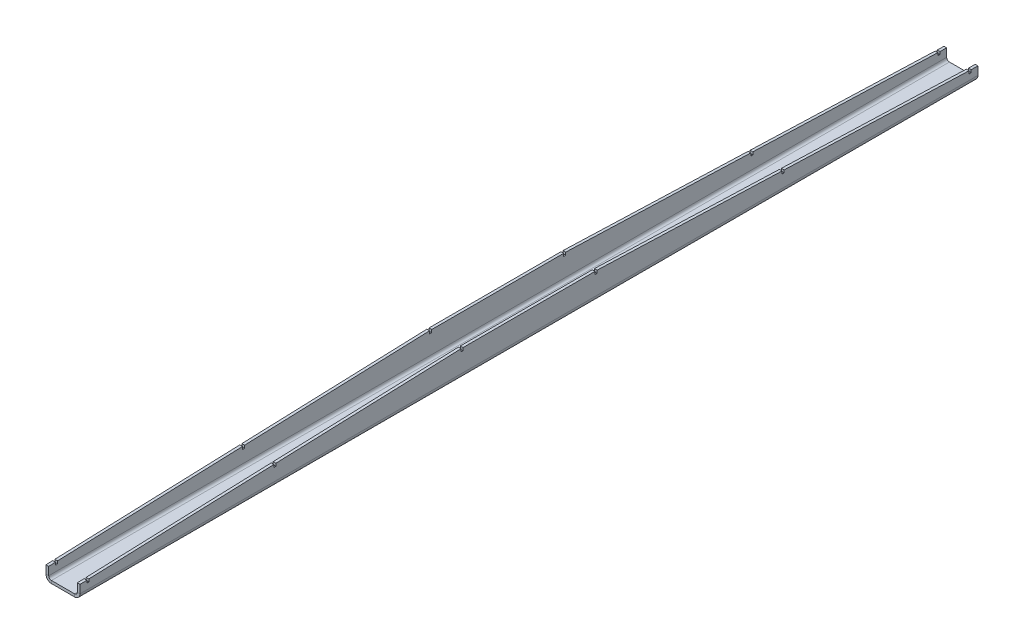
ISO-10303-21;
HEADER;
FILE_DESCRIPTION(('STEP AP214'),'2;1');
FILE_NAME('part.step','',(''),(''),'','','');
FILE_SCHEMA(('AUTOMOTIVE_DESIGN { 1 0 10303 214 1 1 1 1 }'));
ENDSEC;
DATA;
#1=APPLICATION_CONTEXT('core data for automotive mechanical design processes');
#2=APPLICATION_PROTOCOL_DEFINITION('international standard','automotive_design',2000,#1);
#3=PRODUCT_CONTEXT('',#1,'mechanical');
#4=PRODUCT('Part','Part','',(#3));
#5=PRODUCT_RELATED_PRODUCT_CATEGORY('part','',(#4));
#6=PRODUCT_DEFINITION_FORMATION('','',#4);
#7=PRODUCT_DEFINITION_CONTEXT('part definition',#1,'design');
#8=PRODUCT_DEFINITION('design','',#6,#7);
#9=PRODUCT_DEFINITION_SHAPE('','',#8);
#10=(LENGTH_UNIT() NAMED_UNIT(*) SI_UNIT(.MILLI.,.METRE.));
#11=(NAMED_UNIT(*) PLANE_ANGLE_UNIT() SI_UNIT($,.RADIAN.));
#12=(NAMED_UNIT(*) SI_UNIT($,.STERADIAN.) SOLID_ANGLE_UNIT());
#13=UNCERTAINTY_MEASURE_WITH_UNIT(LENGTH_MEASURE(1.E-05),#10,'distance_accuracy_value','');
#14=(GEOMETRIC_REPRESENTATION_CONTEXT(3) GLOBAL_UNCERTAINTY_ASSIGNED_CONTEXT((#13)) GLOBAL_UNIT_ASSIGNED_CONTEXT((#10,
#11,#12)) REPRESENTATION_CONTEXT('',''));
#15=CARTESIAN_POINT('',(0.,0.,0.));
#16=DIRECTION('',(0.,0.,1.));
#17=DIRECTION('',(1.,0.,0.));
#18=AXIS2_PLACEMENT_3D('',#15,#16,#17);
#19=CARTESIAN_POINT('',(25.0000000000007,4.16333634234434E-13,660.000000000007));
#20=DIRECTION('',(1.00000000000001,0.,0.));
#21=DIRECTION('',(0.,0.,-1.00000000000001));
#22=AXIS2_PLACEMENT_3D('',#19,#20,#21);
#23=PLANE('',#22);
#24=DIRECTION('',(0.,0.,-1.00000000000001));
#25=VECTOR('',#24,1.);
#26=CARTESIAN_POINT('',(25.0000000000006,18.0000000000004,660.000000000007));
#27=LINE('',#26,#25);
#28=CARTESIAN_POINT('',(25.0000000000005,18.0000000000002,380.000000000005));
#29=VERTEX_POINT('',#28);
#30=CARTESIAN_POINT('',(25.0000000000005,18.0000000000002,378.500000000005));
#31=VERTEX_POINT('',#30);
#32=EDGE_CURVE('E422',#29,#31,#27,.T.);
#33=ORIENTED_EDGE('',*,*,#32,.F.);
#34=DIRECTION('',(0.,1.,0.));
#35=VECTOR('',#34,1.);
#36=CARTESIAN_POINT('',(25.0000000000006,2.08166817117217E-13,380.000000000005));
#37=LINE('',#36,#35);
#38=CARTESIAN_POINT('',(25.0000000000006,20.0000000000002,380.000000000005));
#39=VERTEX_POINT('',#38);
#40=EDGE_CURVE('E991',#39,#29,#37,.F.);
#41=ORIENTED_EDGE('',*,*,#40,.F.);
#42=DIRECTION('',(0.,-0.035691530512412,0.999362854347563));
#43=VECTOR('',#42,1.);
#44=CARTESIAN_POINT('',(25.0000000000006,9.98726114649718,660.356687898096));
#45=LINE('',#44,#43);
#46=CARTESIAN_POINT('',(25.0000000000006,15.1428571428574,516.000000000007));
#47=VERTEX_POINT('',#46);
#48=EDGE_CURVE('E680',#39,#47,#45,.T.);
#49=ORIENTED_EDGE('',*,*,#48,.T.);
#50=DIRECTION('',(0.,1.,0.));
#51=VECTOR('',#50,1.);
#52=CARTESIAN_POINT('',(25.0000000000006,3.12250225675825E-13,516.000000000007));
#53=LINE('',#52,#51);
#54=CARTESIAN_POINT('',(25.0000000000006,13.1428571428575,516.000000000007));
#55=VERTEX_POINT('',#54);
#56=EDGE_CURVE('E813',#55,#47,#53,.T.);
#57=ORIENTED_EDGE('',*,*,#56,.F.);
#58=DIRECTION('',(0.,0.,-1.00000000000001));
#59=VECTOR('',#58,1.);
#60=CARTESIAN_POINT('',(25.0000000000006,13.1428571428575,660.000000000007));
#61=LINE('',#60,#59);
#62=CARTESIAN_POINT('',(25.0000000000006,13.1428571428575,517.500000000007));
#63=VERTEX_POINT('',#62);
#64=EDGE_CURVE('E821',#63,#55,#61,.T.);
#65=ORIENTED_EDGE('',*,*,#64,.F.);
#66=DIRECTION('',(0.,1.,0.));
#67=VECTOR('',#66,1.);
#68=CARTESIAN_POINT('',(25.0000000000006,3.12250225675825E-13,517.500000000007));
#69=LINE('',#68,#67);
#70=CARTESIAN_POINT('',(25.0000000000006,15.089285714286,517.500000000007));
#71=VERTEX_POINT('',#70);
#72=EDGE_CURVE('E803',#71,#63,#69,.F.);
#73=ORIENTED_EDGE('',*,*,#72,.F.);
#74=CARTESIAN_POINT('',(25.0000000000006,10.2321428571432,653.500000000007));
#75=VERTEX_POINT('',#74);
#76=EDGE_CURVE('E684',#71,#75,#45,.T.);
#77=ORIENTED_EDGE('',*,*,#76,.T.);
#78=DIRECTION('',(0.,1.,0.));
#79=VECTOR('',#78,1.);
#80=CARTESIAN_POINT('',(25.0000000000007,3.12250225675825E-13,653.500000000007));
#81=LINE('',#80,#79);
#82=CARTESIAN_POINT('',(25.0000000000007,8.23214285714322,653.500000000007));
#83=VERTEX_POINT('',#82);
#84=EDGE_CURVE('E760',#83,#75,#81,.T.);
#85=ORIENTED_EDGE('',*,*,#84,.F.);
#86=DIRECTION('',(0.,0.,-1.00000000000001));
#87=VECTOR('',#86,1.);
#88=CARTESIAN_POINT('',(25.0000000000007,8.23214285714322,660.000000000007));
#89=LINE('',#88,#87);
#90=CARTESIAN_POINT('',(25.0000000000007,8.23214285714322,655.000000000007));
#91=VERTEX_POINT('',#90);
#92=EDGE_CURVE('E768',#91,#83,#89,.T.);
#93=ORIENTED_EDGE('',*,*,#92,.F.);
#94=DIRECTION('',(0.,1.,0.));
#95=VECTOR('',#94,1.);
#96=CARTESIAN_POINT('',(25.0000000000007,3.12250225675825E-13,655.000000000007));
#97=LINE('',#96,#95);
#98=CARTESIAN_POINT('',(25.0000000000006,10.1785714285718,655.000000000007));
#99=VERTEX_POINT('',#98);
#100=EDGE_CURVE('E750',#99,#91,#97,.F.);
#101=ORIENTED_EDGE('',*,*,#100,.F.);
#102=CARTESIAN_POINT('',(25.0000000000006,10.0000000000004,660.000000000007));
#103=VERTEX_POINT('',#102);
#104=EDGE_CURVE('E685',#99,#103,#45,.T.);
#105=ORIENTED_EDGE('',*,*,#104,.T.);
#106=DIRECTION('',(0.,-1.,0.));
#107=VECTOR('',#106,1.);
#108=CARTESIAN_POINT('',(25.0000000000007,4.16333634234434E-13,660.000000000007));
#109=LINE('',#108,#107);
#110=CARTESIAN_POINT('',(25.0000000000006,4.00000000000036,660.000000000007));
#111=VERTEX_POINT('',#110);
#112=EDGE_CURVE('E477',#103,#111,#109,.T.);
#113=ORIENTED_EDGE('',*,*,#112,.T.);
#114=DIRECTION('',(0.,0.,-1.00000000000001));
#115=VECTOR('',#114,1.);
#116=CARTESIAN_POINT('',(25.0000000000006,4.00000000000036,660.000000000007));
#117=LINE('',#116,#115);
#118=CARTESIAN_POINT('',(25.0000000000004,4.,0.));
#119=VERTEX_POINT('',#118);
#120=EDGE_CURVE('E437',#111,#119,#117,.T.);
#121=ORIENTED_EDGE('',*,*,#120,.T.);
#122=DIRECTION('',(0.,-1.,0.));
#123=VECTOR('',#122,1.);
#124=CARTESIAN_POINT('',(25.0000000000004,0.,0.));
#125=LINE('',#124,#123);
#126=CARTESIAN_POINT('',(25.0000000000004,9.99999999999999,0.));
#127=VERTEX_POINT('',#126);
#128=EDGE_CURVE('E525',#127,#119,#125,.T.);
#129=ORIENTED_EDGE('',*,*,#128,.F.);
#130=DIRECTION('',(0.,0.0356915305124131,0.999362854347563));
#131=VECTOR('',#130,1.);
#132=CARTESIAN_POINT('',(25.0000000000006,33.5286624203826,658.802547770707));
#133=LINE('',#132,#131);
#134=CARTESIAN_POINT('',(25.0000000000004,10.1785714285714,4.99999999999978));
#135=VERTEX_POINT('',#134);
#136=EDGE_CURVE('E659',#127,#135,#133,.T.);
#137=ORIENTED_EDGE('',*,*,#136,.T.);
#138=DIRECTION('',(0.,1.,0.));
#139=VECTOR('',#138,1.);
#140=CARTESIAN_POINT('',(25.0000000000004,0.,5.));
#141=LINE('',#140,#139);
#142=CARTESIAN_POINT('',(25.0000000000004,8.23214285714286,5.));
#143=VERTEX_POINT('',#142);
#144=EDGE_CURVE('E917',#143,#135,#141,.T.);
#145=ORIENTED_EDGE('',*,*,#144,.F.);
#146=DIRECTION('',(0.,0.,-1.00000000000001));
#147=VECTOR('',#146,1.);
#148=CARTESIAN_POINT('',(25.0000000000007,8.23214285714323,660.000000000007));
#149=LINE('',#148,#147);
#150=CARTESIAN_POINT('',(25.0000000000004,8.23214285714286,6.49999999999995));
#151=VERTEX_POINT('',#150);
#152=EDGE_CURVE('E904',#151,#143,#149,.T.);
#153=ORIENTED_EDGE('',*,*,#152,.F.);
#154=DIRECTION('',(0.,1.,0.));
#155=VECTOR('',#154,1.);
#156=CARTESIAN_POINT('',(25.0000000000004,0.,6.49999999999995));
#157=LINE('',#156,#155);
#158=CARTESIAN_POINT('',(25.0000000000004,10.2321428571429,6.49999999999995));
#159=VERTEX_POINT('',#158);
#160=EDGE_CURVE('E913',#159,#151,#157,.F.);
#161=ORIENTED_EDGE('',*,*,#160,.F.);
#162=CARTESIAN_POINT('',(25.0000000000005,15.0892857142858,142.5));
#163=VERTEX_POINT('',#162);
#164=EDGE_CURVE('E665',#159,#163,#133,.T.);
#165=ORIENTED_EDGE('',*,*,#164,.T.);
#166=DIRECTION('',(0.,1.,0.));
#167=VECTOR('',#166,1.);
#168=CARTESIAN_POINT('',(25.0000000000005,1.04083408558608E-13,142.5));
#169=LINE('',#168,#167);
#170=CARTESIAN_POINT('',(25.0000000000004,13.1428571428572,142.5));
#171=VERTEX_POINT('',#170);
#172=EDGE_CURVE('E873',#171,#163,#169,.T.);
#173=ORIENTED_EDGE('',*,*,#172,.F.);
#174=DIRECTION('',(0.,0.,-1.00000000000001));
#175=VECTOR('',#174,1.);
#176=CARTESIAN_POINT('',(25.0000000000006,13.1428571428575,660.000000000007));
#177=LINE('',#176,#175);
#178=CARTESIAN_POINT('',(25.0000000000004,13.1428571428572,144.));
#179=VERTEX_POINT('',#178);
#180=EDGE_CURVE('E854',#179,#171,#177,.T.);
#181=ORIENTED_EDGE('',*,*,#180,.F.);
#182=DIRECTION('',(0.,1.,0.));
#183=VECTOR('',#182,1.);
#184=CARTESIAN_POINT('',(25.0000000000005,1.04083408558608E-13,144.));
#185=LINE('',#184,#183);
#186=CARTESIAN_POINT('',(25.0000000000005,15.1428571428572,144.));
#187=VERTEX_POINT('',#186);
#188=EDGE_CURVE('E865',#187,#179,#185,.F.);
#189=ORIENTED_EDGE('',*,*,#188,.F.);
#190=CARTESIAN_POINT('',(25.0000000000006,20.0000000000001,280.000000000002));
#191=VERTEX_POINT('',#190);
#192=EDGE_CURVE('E666',#187,#191,#133,.T.);
#193=ORIENTED_EDGE('',*,*,#192,.T.);
#194=DIRECTION('',(0.,1.,0.));
#195=VECTOR('',#194,1.);
#196=CARTESIAN_POINT('',(25.0000000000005,1.04083408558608E-13,280.000000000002));
#197=LINE('',#196,#195);
#198=CARTESIAN_POINT('',(25.0000000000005,18.0000000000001,280.000000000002));
#199=VERTEX_POINT('',#198);
#200=EDGE_CURVE('E931',#199,#191,#197,.T.);
#201=ORIENTED_EDGE('',*,*,#200,.F.);
#202=DIRECTION('',(0.,0.,-1.00000000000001));
#203=VECTOR('',#202,1.);
#204=CARTESIAN_POINT('',(25.0000000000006,18.0000000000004,660.000000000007));
#205=LINE('',#204,#203);
#206=CARTESIAN_POINT('',(25.0000000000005,18.0000000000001,281.500000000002));
#207=VERTEX_POINT('',#206);
#208=EDGE_CURVE('E939',#207,#199,#205,.T.);
#209=ORIENTED_EDGE('',*,*,#208,.F.);
#210=DIRECTION('',(0.,1.,0.));
#211=VECTOR('',#210,1.);
#212=CARTESIAN_POINT('',(25.0000000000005,1.04083408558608E-13,281.500000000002));
#213=LINE('',#212,#211);
#214=CARTESIAN_POINT('',(25.0000000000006,20.0000000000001,281.500000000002));
#215=VERTEX_POINT('',#214);
#216=EDGE_CURVE('E436',#215,#207,#213,.F.);
#217=ORIENTED_EDGE('',*,*,#216,.F.);
#218=DIRECTION('',(0.,0.,-1.00000000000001));
#219=VECTOR('',#218,1.);
#220=CARTESIAN_POINT('',(25.0000000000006,20.0000000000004,660.000000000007));
#221=LINE('',#220,#219);
#222=CARTESIAN_POINT('',(25.0000000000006,20.0000000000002,378.500000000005));
#223=VERTEX_POINT('',#222);
#224=EDGE_CURVE('E429',#223,#215,#221,.T.);
#225=ORIENTED_EDGE('',*,*,#224,.F.);
#226=DIRECTION('',(0.,1.,0.));
#227=VECTOR('',#226,1.);
#228=CARTESIAN_POINT('',(25.0000000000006,2.08166817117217E-13,378.500000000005));
#229=LINE('',#228,#227);
#230=EDGE_CURVE('E412',#31,#223,#229,.T.);
#231=ORIENTED_EDGE('',*,*,#230,.F.);
#232=EDGE_LOOP('',(#33,#41,#49,#57,#65,#73,#77,#85,#93,#101,#105,#113,#121,#129,#137,#145,#153,
#161,#165,#173,#181,#189,#193,#201,#209,#217,#225,#231));
#233=FACE_BOUND('',#232,.T.);
#234=ADVANCED_FACE('F34',(#233),#23,.T.);
#235=CARTESIAN_POINT('',(23.0000000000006,4.16333634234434E-13,660.000000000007));
#236=DIRECTION('',(1.00000000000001,0.,0.));
#237=DIRECTION('',(0.,0.,-1.00000000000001));
#238=AXIS2_PLACEMENT_3D('',#235,#236,#237);
#239=PLANE('',#238);
#240=DIRECTION('',(0.,-1.,0.));
#241=VECTOR('',#240,1.);
#242=CARTESIAN_POINT('',(23.0000000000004,2.08166817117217E-13,380.000000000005));
#243=LINE('',#242,#241);
#244=CARTESIAN_POINT('',(23.0000000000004,20.0000000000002,380.000000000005));
#245=VERTEX_POINT('',#244);
#246=CARTESIAN_POINT('',(23.0000000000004,18.0000000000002,380.000000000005));
#247=VERTEX_POINT('',#246);
#248=EDGE_CURVE('E423',#245,#247,#243,.T.);
#249=ORIENTED_EDGE('',*,*,#248,.T.);
#250=DIRECTION('',(0.,0.,-1.00000000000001));
#251=VECTOR('',#250,1.);
#252=CARTESIAN_POINT('',(23.0000000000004,18.0000000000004,660.000000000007));
#253=LINE('',#252,#251);
#254=CARTESIAN_POINT('',(23.0000000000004,18.0000000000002,378.500000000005));
#255=VERTEX_POINT('',#254);
#256=EDGE_CURVE('E995',#247,#255,#253,.T.);
#257=ORIENTED_EDGE('',*,*,#256,.T.);
#258=DIRECTION('',(0.,1.,0.));
#259=VECTOR('',#258,1.);
#260=CARTESIAN_POINT('',(23.0000000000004,2.08166817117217E-13,378.500000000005));
#261=LINE('',#260,#259);
#262=CARTESIAN_POINT('',(23.0000000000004,20.0000000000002,378.500000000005));
#263=VERTEX_POINT('',#262);
#264=EDGE_CURVE('E998',#255,#263,#261,.T.);
#265=ORIENTED_EDGE('',*,*,#264,.T.);
#266=DIRECTION('',(0.,0.,-1.00000000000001));
#267=VECTOR('',#266,1.);
#268=CARTESIAN_POINT('',(23.0000000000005,20.0000000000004,660.000000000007));
#269=LINE('',#268,#267);
#270=CARTESIAN_POINT('',(23.0000000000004,20.0000000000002,281.500000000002));
#271=VERTEX_POINT('',#270);
#272=EDGE_CURVE('E431',#263,#271,#269,.T.);
#273=ORIENTED_EDGE('',*,*,#272,.T.);
#274=DIRECTION('',(0.,-1.,0.));
#275=VECTOR('',#274,1.);
#276=CARTESIAN_POINT('',(23.0000000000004,2.08166817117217E-13,281.500000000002));
#277=LINE('',#276,#275);
#278=CARTESIAN_POINT('',(23.0000000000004,18.0000000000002,281.500000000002));
#279=VERTEX_POINT('',#278);
#280=EDGE_CURVE('E928',#271,#279,#277,.T.);
#281=ORIENTED_EDGE('',*,*,#280,.T.);
#282=DIRECTION('',(0.,0.,-1.00000000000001));
#283=VECTOR('',#282,1.);
#284=CARTESIAN_POINT('',(23.0000000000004,18.0000000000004,660.000000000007));
#285=LINE('',#284,#283);
#286=CARTESIAN_POINT('',(23.0000000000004,18.0000000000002,280.000000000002));
#287=VERTEX_POINT('',#286);
#288=EDGE_CURVE('E932',#279,#287,#285,.T.);
#289=ORIENTED_EDGE('',*,*,#288,.T.);
#290=DIRECTION('',(0.,1.,0.));
#291=VECTOR('',#290,1.);
#292=CARTESIAN_POINT('',(23.0000000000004,2.08166817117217E-13,280.000000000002));
#293=LINE('',#292,#291);
#294=CARTESIAN_POINT('',(23.0000000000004,20.0000000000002,280.000000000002));
#295=VERTEX_POINT('',#294);
#296=EDGE_CURVE('E935',#287,#295,#293,.T.);
#297=ORIENTED_EDGE('',*,*,#296,.T.);
#298=DIRECTION('',(0.,0.0356915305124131,0.999362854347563));
#299=VECTOR('',#298,1.);
#300=CARTESIAN_POINT('',(23.0000000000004,33.5286624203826,658.802547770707));
#301=LINE('',#300,#299);
#302=CARTESIAN_POINT('',(23.0000000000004,15.1428571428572,144.));
#303=VERTEX_POINT('',#302);
#304=EDGE_CURVE('E654',#303,#295,#301,.T.);
#305=ORIENTED_EDGE('',*,*,#304,.F.);
#306=DIRECTION('',(0.,-1.,0.));
#307=VECTOR('',#306,1.);
#308=CARTESIAN_POINT('',(23.0000000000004,7.26502191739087E-12,144.));
#309=LINE('',#308,#307);
#310=CARTESIAN_POINT('',(23.0000000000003,13.1428571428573,144.));
#311=VERTEX_POINT('',#310);
#312=EDGE_CURVE('E869',#303,#311,#309,.T.);
#313=ORIENTED_EDGE('',*,*,#312,.T.);
#314=DIRECTION('',(0.,0.,-1.00000000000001));
#315=VECTOR('',#314,1.);
#316=CARTESIAN_POINT('',(23.0000000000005,13.142857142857,660.000000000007));
#317=LINE('',#316,#315);
#318=CARTESIAN_POINT('',(23.0000000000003,13.1428571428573,142.5));
#319=VERTEX_POINT('',#318);
#320=EDGE_CURVE('E862',#311,#319,#317,.T.);
#321=ORIENTED_EDGE('',*,*,#320,.T.);
#322=DIRECTION('',(0.,1.,0.));
#323=VECTOR('',#322,1.);
#324=CARTESIAN_POINT('',(23.0000000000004,1.04083408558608E-13,142.5));
#325=LINE('',#324,#323);
#326=CARTESIAN_POINT('',(23.0000000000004,15.0892857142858,142.5));
#327=VERTEX_POINT('',#326);
#328=EDGE_CURVE('E866',#319,#327,#325,.T.);
#329=ORIENTED_EDGE('',*,*,#328,.T.);
#330=CARTESIAN_POINT('',(23.0000000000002,10.2321428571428,6.49999999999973));
#331=VERTEX_POINT('',#330);
#332=EDGE_CURVE('E652',#331,#327,#301,.T.);
#333=ORIENTED_EDGE('',*,*,#332,.F.);
#334=DIRECTION('',(0.,-1.,0.));
#335=VECTOR('',#334,1.);
#336=CARTESIAN_POINT('',(23.0000000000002,0.,6.49999999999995));
#337=LINE('',#336,#335);
#338=CARTESIAN_POINT('',(23.0000000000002,8.23214285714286,6.49999999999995));
#339=VERTEX_POINT('',#338);
#340=EDGE_CURVE('E49',#331,#339,#337,.T.);
#341=ORIENTED_EDGE('',*,*,#340,.T.);
#342=DIRECTION('',(0.,0.,-1.00000000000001));
#343=VECTOR('',#342,1.);
#344=CARTESIAN_POINT('',(23.0000000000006,8.23214285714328,660.000000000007));
#345=LINE('',#344,#343);
#346=CARTESIAN_POINT('',(23.0000000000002,8.23214285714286,5.));
#347=VERTEX_POINT('',#346);
#348=EDGE_CURVE('E911',#339,#347,#345,.T.);
#349=ORIENTED_EDGE('',*,*,#348,.T.);
#350=DIRECTION('',(0.,1.,0.));
#351=VECTOR('',#350,1.);
#352=CARTESIAN_POINT('',(23.0000000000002,0.,5.));
#353=LINE('',#352,#351);
#354=CARTESIAN_POINT('',(23.0000000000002,10.1785714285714,4.99999999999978));
#355=VERTEX_POINT('',#354);
#356=EDGE_CURVE('E649',#347,#355,#353,.T.);
#357=ORIENTED_EDGE('',*,*,#356,.T.);
#358=CARTESIAN_POINT('',(23.0000000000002,10.,0.));
#359=VERTEX_POINT('',#358);
#360=EDGE_CURVE('E647',#359,#355,#301,.T.);
#361=ORIENTED_EDGE('',*,*,#360,.F.);
#362=DIRECTION('',(0.,1.,0.));
#363=VECTOR('',#362,1.);
#364=CARTESIAN_POINT('',(23.0000000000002,0.,0.));
#365=LINE('',#364,#363);
#366=CARTESIAN_POINT('',(23.0000000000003,4.,0.));
#367=VERTEX_POINT('',#366);
#368=EDGE_CURVE('E527',#359,#367,#365,.F.);
#369=ORIENTED_EDGE('',*,*,#368,.T.);
#370=DIRECTION('',(0.,0.,-1.00000000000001));
#371=VECTOR('',#370,1.);
#372=CARTESIAN_POINT('',(23.0000000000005,4.00000000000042,660.000000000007));
#373=LINE('',#372,#371);
#374=CARTESIAN_POINT('',(23.0000000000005,4.00000000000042,660.000000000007));
#375=VERTEX_POINT('',#374);
#376=EDGE_CURVE('E442',#375,#367,#373,.T.);
#377=ORIENTED_EDGE('',*,*,#376,.F.);
#378=DIRECTION('',(0.,1.,0.));
#379=VECTOR('',#378,1.);
#380=CARTESIAN_POINT('',(23.0000000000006,4.16333634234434E-13,660.000000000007));
#381=LINE('',#380,#379);
#382=CARTESIAN_POINT('',(23.0000000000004,10.0000000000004,660.000000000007));
#383=VERTEX_POINT('',#382);
#384=EDGE_CURVE('E479',#383,#375,#381,.F.);
#385=ORIENTED_EDGE('',*,*,#384,.F.);
#386=DIRECTION('',(0.,-0.035691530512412,0.999362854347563));
#387=VECTOR('',#386,1.);
#388=CARTESIAN_POINT('',(23.0000000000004,9.98726114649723,660.356687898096));
#389=LINE('',#388,#387);
#390=CARTESIAN_POINT('',(23.0000000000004,10.1785714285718,655.000000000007));
#391=VERTEX_POINT('',#390);
#392=EDGE_CURVE('E683',#391,#383,#389,.T.);
#393=ORIENTED_EDGE('',*,*,#392,.F.);
#394=DIRECTION('',(0.,-1.,0.));
#395=VECTOR('',#394,1.);
#396=CARTESIAN_POINT('',(23.0000000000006,4.16333634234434E-13,655.000000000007));
#397=LINE('',#396,#395);
#398=CARTESIAN_POINT('',(23.0000000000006,8.23214285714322,655.000000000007));
#399=VERTEX_POINT('',#398);
#400=EDGE_CURVE('E757',#391,#399,#397,.T.);
#401=ORIENTED_EDGE('',*,*,#400,.T.);
#402=DIRECTION('',(0.,0.,-1.00000000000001));
#403=VECTOR('',#402,1.);
#404=CARTESIAN_POINT('',(23.0000000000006,8.23214285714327,660.000000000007));
#405=LINE('',#404,#403);
#406=CARTESIAN_POINT('',(23.0000000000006,8.23214285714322,653.500000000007));
#407=VERTEX_POINT('',#406);
#408=EDGE_CURVE('E761',#399,#407,#405,.T.);
#409=ORIENTED_EDGE('',*,*,#408,.T.);
#410=DIRECTION('',(0.,1.,0.));
#411=VECTOR('',#410,1.);
#412=CARTESIAN_POINT('',(23.0000000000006,4.16333634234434E-13,653.500000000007));
#413=LINE('',#412,#411);
#414=CARTESIAN_POINT('',(23.0000000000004,10.2321428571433,653.500000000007));
#415=VERTEX_POINT('',#414);
#416=EDGE_CURVE('E764',#407,#415,#413,.T.);
#417=ORIENTED_EDGE('',*,*,#416,.T.);
#418=CARTESIAN_POINT('',(23.0000000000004,15.089285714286,517.500000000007));
#419=VERTEX_POINT('',#418);
#420=EDGE_CURVE('E688',#419,#415,#389,.T.);
#421=ORIENTED_EDGE('',*,*,#420,.F.);
#422=DIRECTION('',(0.,-1.,0.));
#423=VECTOR('',#422,1.);
#424=CARTESIAN_POINT('',(23.0000000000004,3.12250225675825E-13,517.500000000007));
#425=LINE('',#424,#423);
#426=CARTESIAN_POINT('',(23.0000000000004,13.1428571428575,517.500000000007));
#427=VERTEX_POINT('',#426);
#428=EDGE_CURVE('E810',#419,#427,#425,.T.);
#429=ORIENTED_EDGE('',*,*,#428,.T.);
#430=DIRECTION('',(0.,0.,-1.00000000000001));
#431=VECTOR('',#430,1.);
#432=CARTESIAN_POINT('',(23.0000000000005,13.1428571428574,660.000000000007));
#433=LINE('',#432,#431);
#434=CARTESIAN_POINT('',(23.0000000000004,13.1428571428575,516.000000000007));
#435=VERTEX_POINT('',#434);
#436=EDGE_CURVE('E814',#427,#435,#433,.T.);
#437=ORIENTED_EDGE('',*,*,#436,.T.);
#438=DIRECTION('',(0.,1.,0.));
#439=VECTOR('',#438,1.);
#440=CARTESIAN_POINT('',(23.0000000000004,3.12250225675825E-13,516.000000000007));
#441=LINE('',#440,#439);
#442=CARTESIAN_POINT('',(23.0000000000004,15.1428571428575,516.000000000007));
#443=VERTEX_POINT('',#442);
#444=EDGE_CURVE('E817',#435,#443,#441,.T.);
#445=ORIENTED_EDGE('',*,*,#444,.T.);
#446=EDGE_CURVE('E678',#245,#443,#389,.T.);
#447=ORIENTED_EDGE('',*,*,#446,.F.);
#448=EDGE_LOOP('',(#249,#257,#265,#273,#281,#289,#297,#305,#313,#321,#329,#333,#341,#349,#357,
#361,#369,#377,#385,#393,#401,#409,#417,#421,#429,#437,#445,#447));
#449=FACE_BOUND('',#448,.T.);
#450=ADVANCED_FACE('F595',(#449),#239,.F.);
#451=CARTESIAN_POINT('',(23.0000000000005,20.0000000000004,660.000000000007));
#452=DIRECTION('',(0.,1.,0.));
#453=DIRECTION('',(0.,0.,1.00000000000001));
#454=AXIS2_PLACEMENT_3D('',#451,#452,#453);
#455=PLANE('',#454);
#456=ORIENTED_EDGE('',*,*,#272,.F.);
#457=DIRECTION('',(-1.00000000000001,0.,0.));
#458=VECTOR('',#457,1.);
#459=CARTESIAN_POINT('',(23.0000000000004,20.0000000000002,378.500000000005));
#460=LINE('',#459,#458);
#461=EDGE_CURVE('E415',#263,#223,#460,.F.);
#462=ORIENTED_EDGE('',*,*,#461,.T.);
#463=ORIENTED_EDGE('',*,*,#224,.T.);
#464=DIRECTION('',(-1.00000000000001,0.,0.));
#465=VECTOR('',#464,1.);
#466=CARTESIAN_POINT('',(23.0000000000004,20.0000000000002,281.500000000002));
#467=LINE('',#466,#465);
#468=EDGE_CURVE('E924',#271,#215,#467,.F.);
#469=ORIENTED_EDGE('',*,*,#468,.F.);
#470=EDGE_LOOP('',(#456,#462,#463,#469));
#471=FACE_BOUND('',#470,.T.);
#472=ADVANCED_FACE('F427',(#471),#455,.T.);
#473=CARTESIAN_POINT('',(2.00000000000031,3.12250225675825E-13,660.000000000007));
#474=DIRECTION('',(-1.00000000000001,0.,0.));
#475=DIRECTION('',(0.,0.,1.00000000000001));
#476=AXIS2_PLACEMENT_3D('',#473,#474,#475);
#477=PLANE('',#476);
#478=DIRECTION('',(0.,-1.,0.));
#479=VECTOR('',#478,1.);
#480=CARTESIAN_POINT('',(2.00000000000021,2.08166817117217E-13,378.500000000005));
#481=LINE('',#480,#479);
#482=CARTESIAN_POINT('',(2.00000000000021,20.0000000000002,378.500000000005));
#483=VERTEX_POINT('',#482);
#484=CARTESIAN_POINT('',(2.00000000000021,18.0000000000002,378.500000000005));
#485=VERTEX_POINT('',#484);
#486=EDGE_CURVE('E976',#483,#485,#481,.T.);
#487=ORIENTED_EDGE('',*,*,#486,.T.);
#488=DIRECTION('',(0.,0.,1.00000000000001));
#489=VECTOR('',#488,1.);
#490=CARTESIAN_POINT('',(2.00000000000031,18.0000000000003,660.000000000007));
#491=LINE('',#490,#489);
#492=CARTESIAN_POINT('',(2.00000000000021,18.0000000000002,380.000000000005));
#493=VERTEX_POINT('',#492);
#494=EDGE_CURVE('E980',#485,#493,#491,.T.);
#495=ORIENTED_EDGE('',*,*,#494,.T.);
#496=DIRECTION('',(0.,1.,0.));
#497=VECTOR('',#496,1.);
#498=CARTESIAN_POINT('',(2.00000000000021,2.08166817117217E-13,380.000000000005));
#499=LINE('',#498,#497);
#500=CARTESIAN_POINT('',(2.00000000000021,20.0000000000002,380.000000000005));
#501=VERTEX_POINT('',#500);
#502=EDGE_CURVE('E983',#493,#501,#499,.T.);
#503=ORIENTED_EDGE('',*,*,#502,.T.);
#504=DIRECTION('',(0.,0.035691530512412,-0.999362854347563));
#505=VECTOR('',#504,1.);
#506=CARTESIAN_POINT('',(2.00000000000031,9.98726114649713,660.356687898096));
#507=LINE('',#506,#505);
#508=CARTESIAN_POINT('',(2.00000000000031,15.1428571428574,516.000000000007));
#509=VERTEX_POINT('',#508);
#510=EDGE_CURVE('E713',#509,#501,#507,.T.);
#511=ORIENTED_EDGE('',*,*,#510,.F.);
#512=DIRECTION('',(0.,-1.,0.));
#513=VECTOR('',#512,1.);
#514=CARTESIAN_POINT('',(2.00000000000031,3.12250225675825E-13,516.000000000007));
#515=LINE('',#514,#513);
#516=CARTESIAN_POINT('',(2.00000000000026,13.1428571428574,516.000000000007));
#517=VERTEX_POINT('',#516);
#518=EDGE_CURVE('E784',#509,#517,#515,.T.);
#519=ORIENTED_EDGE('',*,*,#518,.T.);
#520=DIRECTION('',(0.,0.,1.00000000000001));
#521=VECTOR('',#520,1.);
#522=CARTESIAN_POINT('',(2.00000000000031,13.1428571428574,660.000000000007));
#523=LINE('',#522,#521);
#524=CARTESIAN_POINT('',(2.00000000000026,13.1428571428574,517.500000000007));
#525=VERTEX_POINT('',#524);
#526=EDGE_CURVE('E788',#517,#525,#523,.T.);
#527=ORIENTED_EDGE('',*,*,#526,.T.);
#528=DIRECTION('',(0.,1.,0.));
#529=VECTOR('',#528,1.);
#530=CARTESIAN_POINT('',(2.00000000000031,3.12250225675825E-13,517.500000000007));
#531=LINE('',#530,#529);
#532=CARTESIAN_POINT('',(2.00000000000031,15.089285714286,517.500000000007));
#533=VERTEX_POINT('',#532);
#534=EDGE_CURVE('E791',#525,#533,#531,.T.);
#535=ORIENTED_EDGE('',*,*,#534,.T.);
#536=CARTESIAN_POINT('',(2.00000000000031,10.2321428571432,653.500000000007));
#537=VERTEX_POINT('',#536);
#538=EDGE_CURVE('E718',#537,#533,#507,.T.);
#539=ORIENTED_EDGE('',*,*,#538,.F.);
#540=DIRECTION('',(0.,-1.,0.));
#541=VECTOR('',#540,1.);
#542=CARTESIAN_POINT('',(2.00000000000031,3.12250225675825E-13,653.500000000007));
#543=LINE('',#542,#541);
#544=CARTESIAN_POINT('',(2.00000000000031,8.23214285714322,653.500000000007));
#545=VERTEX_POINT('',#544);
#546=EDGE_CURVE('E731',#537,#545,#543,.T.);
#547=ORIENTED_EDGE('',*,*,#546,.T.);
#548=DIRECTION('',(0.,0.,1.00000000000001));
#549=VECTOR('',#548,1.);
#550=CARTESIAN_POINT('',(2.00000000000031,8.23214285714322,660.000000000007));
#551=LINE('',#550,#549);
#552=CARTESIAN_POINT('',(2.00000000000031,8.23214285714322,655.000000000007));
#553=VERTEX_POINT('',#552);
#554=EDGE_CURVE('E735',#545,#553,#551,.T.);
#555=ORIENTED_EDGE('',*,*,#554,.T.);
#556=DIRECTION('',(0.,1.,0.));
#557=VECTOR('',#556,1.);
#558=CARTESIAN_POINT('',(2.00000000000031,3.12250225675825E-13,655.000000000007));
#559=LINE('',#558,#557);
#560=CARTESIAN_POINT('',(2.00000000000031,10.1785714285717,655.000000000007));
#561=VERTEX_POINT('',#560);
#562=EDGE_CURVE('E738',#553,#561,#559,.T.);
#563=ORIENTED_EDGE('',*,*,#562,.T.);
#564=CARTESIAN_POINT('',(2.00000000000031,10.0000000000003,660.000000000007));
#565=VERTEX_POINT('',#564);
#566=EDGE_CURVE('E708',#565,#561,#507,.T.);
#567=ORIENTED_EDGE('',*,*,#566,.F.);
#568=DIRECTION('',(0.,1.,0.));
#569=VECTOR('',#568,1.);
#570=CARTESIAN_POINT('',(2.00000000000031,3.12250225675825E-13,660.000000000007));
#571=LINE('',#570,#569);
#572=CARTESIAN_POINT('',(2.00000000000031,4.00000000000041,660.000000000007));
#573=VERTEX_POINT('',#572);
#574=EDGE_CURVE('E538',#573,#565,#571,.T.);
#575=ORIENTED_EDGE('',*,*,#574,.F.);
#576=DIRECTION('',(0.,0.,-1.00000000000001));
#577=VECTOR('',#576,1.);
#578=CARTESIAN_POINT('',(2.00000000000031,4.00000000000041,660.000000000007));
#579=LINE('',#578,#577);
#580=CARTESIAN_POINT('',(2.00000000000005,4.,0.));
#581=VERTEX_POINT('',#580);
#582=EDGE_CURVE('E510',#573,#581,#579,.T.);
#583=ORIENTED_EDGE('',*,*,#582,.T.);
#584=DIRECTION('',(0.,1.,0.));
#585=VECTOR('',#584,1.);
#586=CARTESIAN_POINT('',(2.00000000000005,0.,0.));
#587=LINE('',#586,#585);
#588=CARTESIAN_POINT('',(2.00000000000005,10.,0.));
#589=VERTEX_POINT('',#588);
#590=EDGE_CURVE('E511',#581,#589,#587,.T.);
#591=ORIENTED_EDGE('',*,*,#590,.T.);
#592=DIRECTION('',(0.,-0.0356915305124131,-0.999362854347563));
#593=VECTOR('',#592,1.);
#594=CARTESIAN_POINT('',(2.00000000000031,33.5286624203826,658.802547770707));
#595=LINE('',#594,#593);
#596=CARTESIAN_POINT('',(2.00000000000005,10.1785714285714,4.99999999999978));
#597=VERTEX_POINT('',#596);
#598=EDGE_CURVE('E699',#597,#589,#595,.T.);
#599=ORIENTED_EDGE('',*,*,#598,.F.);
#600=DIRECTION('',(0.,-1.,0.));
#601=VECTOR('',#600,1.);
#602=CARTESIAN_POINT('',(2.00000000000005,0.,5.));
#603=LINE('',#602,#601);
#604=CARTESIAN_POINT('',(2.00000000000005,8.23214285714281,5.));
#605=VERTEX_POINT('',#604);
#606=EDGE_CURVE('E887',#597,#605,#603,.T.);
#607=ORIENTED_EDGE('',*,*,#606,.T.);
#608=DIRECTION('',(0.,0.,1.00000000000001));
#609=VECTOR('',#608,1.);
#610=CARTESIAN_POINT('',(2.00000000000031,8.23214285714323,660.000000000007));
#611=LINE('',#610,#609);
#612=CARTESIAN_POINT('',(2.00000000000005,8.23214285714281,6.49999999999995));
#613=VERTEX_POINT('',#612);
#614=EDGE_CURVE('E890',#605,#613,#611,.T.);
#615=ORIENTED_EDGE('',*,*,#614,.T.);
#616=DIRECTION('',(0.,1.,0.));
#617=VECTOR('',#616,1.);
#618=CARTESIAN_POINT('',(2.00000000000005,0.,6.49999999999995));
#619=LINE('',#618,#617);
#620=CARTESIAN_POINT('',(2.00000000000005,10.2321428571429,6.49999999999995));
#621=VERTEX_POINT('',#620);
#622=EDGE_CURVE('E893',#613,#621,#619,.T.);
#623=ORIENTED_EDGE('',*,*,#622,.T.);
#624=CARTESIAN_POINT('',(2.00000000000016,15.0892857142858,142.5));
#625=VERTEX_POINT('',#624);
#626=EDGE_CURVE('E704',#625,#621,#595,.T.);
#627=ORIENTED_EDGE('',*,*,#626,.F.);
#628=DIRECTION('',(0.,-1.,0.));
#629=VECTOR('',#628,1.);
#630=CARTESIAN_POINT('',(2.0000000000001,0.,142.5));
#631=LINE('',#630,#629);
#632=CARTESIAN_POINT('',(2.0000000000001,13.1428571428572,142.5));
#633=VERTEX_POINT('',#632);
#634=EDGE_CURVE('E836',#625,#633,#631,.T.);
#635=ORIENTED_EDGE('',*,*,#634,.T.);
#636=DIRECTION('',(0.,0.,1.00000000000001));
#637=VECTOR('',#636,1.);
#638=CARTESIAN_POINT('',(2.00000000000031,13.1428571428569,660.000000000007));
#639=LINE('',#638,#637);
#640=CARTESIAN_POINT('',(2.0000000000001,13.1428571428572,144.));
#641=VERTEX_POINT('',#640);
#642=EDGE_CURVE('E840',#633,#641,#639,.T.);
#643=ORIENTED_EDGE('',*,*,#642,.T.);
#644=DIRECTION('',(0.,1.,0.));
#645=VECTOR('',#644,1.);
#646=CARTESIAN_POINT('',(2.0000000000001,7.16093850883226E-12,144.));
#647=LINE('',#646,#645);
#648=CARTESIAN_POINT('',(2.00000000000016,15.1428571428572,144.));
#649=VERTEX_POINT('',#648);
#650=EDGE_CURVE('E843',#641,#649,#647,.T.);
#651=ORIENTED_EDGE('',*,*,#650,.T.);
#652=CARTESIAN_POINT('',(2.00000000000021,20.0000000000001,280.000000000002));
#653=VERTEX_POINT('',#652);
#654=EDGE_CURVE('E693',#653,#649,#595,.T.);
#655=ORIENTED_EDGE('',*,*,#654,.F.);
#656=DIRECTION('',(0.,-1.,0.));
#657=VECTOR('',#656,1.);
#658=CARTESIAN_POINT('',(2.00000000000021,1.04083408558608E-13,280.000000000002));
#659=LINE('',#658,#657);
#660=CARTESIAN_POINT('',(2.00000000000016,18.0000000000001,280.000000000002));
#661=VERTEX_POINT('',#660);
#662=EDGE_CURVE('E959',#653,#661,#659,.T.);
#663=ORIENTED_EDGE('',*,*,#662,.T.);
#664=DIRECTION('',(0.,0.,1.00000000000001));
#665=VECTOR('',#664,1.);
#666=CARTESIAN_POINT('',(2.00000000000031,18.0000000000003,660.000000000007));
#667=LINE('',#666,#665);
#668=CARTESIAN_POINT('',(2.00000000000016,18.0000000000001,281.500000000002));
#669=VERTEX_POINT('',#668);
#670=EDGE_CURVE('E952',#661,#669,#667,.T.);
#671=ORIENTED_EDGE('',*,*,#670,.T.);
#672=DIRECTION('',(0.,1.,0.));
#673=VECTOR('',#672,1.);
#674=CARTESIAN_POINT('',(2.00000000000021,1.04083408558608E-13,281.500000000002));
#675=LINE('',#674,#673);
#676=CARTESIAN_POINT('',(2.00000000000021,20.0000000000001,281.500000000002));
#677=VERTEX_POINT('',#676);
#678=EDGE_CURVE('E956',#669,#677,#675,.T.);
#679=ORIENTED_EDGE('',*,*,#678,.T.);
#680=DIRECTION('',(0.,0.,-1.00000000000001));
#681=VECTOR('',#680,1.);
#682=CARTESIAN_POINT('',(2.00000000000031,20.0000000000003,660.000000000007));
#683=LINE('',#682,#681);
#684=EDGE_CURVE('E456',#483,#677,#683,.T.);
#685=ORIENTED_EDGE('',*,*,#684,.F.);
#686=EDGE_LOOP('',(#487,#495,#503,#511,#519,#527,#535,#539,#547,#555,#563,#567,#575,#583,#591,
#599,#607,#615,#623,#627,#635,#643,#651,#655,#663,#671,#679,#685));
#687=FACE_BOUND('',#686,.T.);
#688=ADVANCED_FACE('F613',(#687),#477,.F.);
#689=CARTESIAN_POINT('',(2.60208521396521E-13,4.16333634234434E-13,660.000000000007));
#690=DIRECTION('',(-1.00000000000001,0.,0.));
#691=DIRECTION('',(0.,0.,1.00000000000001));
#692=AXIS2_PLACEMENT_3D('',#689,#690,#691);
#693=PLANE('',#692);
#694=DIRECTION('',(0.,0.,1.00000000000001));
#695=VECTOR('',#694,1.);
#696=CARTESIAN_POINT('',(2.60208521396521E-13,18.0000000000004,660.000000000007));
#697=LINE('',#696,#695);
#698=CARTESIAN_POINT('',(1.56125112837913E-13,18.0000000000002,378.500000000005));
#699=VERTEX_POINT('',#698);
#700=CARTESIAN_POINT('',(1.56125112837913E-13,18.0000000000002,380.000000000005));
#701=VERTEX_POINT('',#700);
#702=EDGE_CURVE('E986',#699,#701,#697,.T.);
#703=ORIENTED_EDGE('',*,*,#702,.F.);
#704=DIRECTION('',(0.,1.,0.));
#705=VECTOR('',#704,1.);
#706=CARTESIAN_POINT('',(1.56125112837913E-13,2.08166817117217E-13,378.500000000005));
#707=LINE('',#706,#705);
#708=CARTESIAN_POINT('',(1.56125112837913E-13,20.0000000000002,378.500000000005));
#709=VERTEX_POINT('',#708);
#710=EDGE_CURVE('E972',#709,#699,#707,.F.);
#711=ORIENTED_EDGE('',*,*,#710,.F.);
#712=DIRECTION('',(0.,0.,-1.00000000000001));
#713=VECTOR('',#712,1.);
#714=CARTESIAN_POINT('',(2.60208521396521E-13,20.0000000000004,660.000000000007));
#715=LINE('',#714,#713);
#716=CARTESIAN_POINT('',(1.04083408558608E-13,20.0000000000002,281.500000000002));
#717=VERTEX_POINT('',#716);
#718=EDGE_CURVE('E454',#709,#717,#715,.T.);
#719=ORIENTED_EDGE('',*,*,#718,.T.);
#720=DIRECTION('',(0.,1.,0.));
#721=VECTOR('',#720,1.);
#722=CARTESIAN_POINT('',(1.04083408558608E-13,1.04083408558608E-13,281.500000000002));
#723=LINE('',#722,#721);
#724=CARTESIAN_POINT('',(1.04083408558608E-13,18.0000000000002,281.500000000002));
#725=VERTEX_POINT('',#724);
#726=EDGE_CURVE('E963',#725,#717,#723,.T.);
#727=ORIENTED_EDGE('',*,*,#726,.F.);
#728=DIRECTION('',(0.,0.,1.00000000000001));
#729=VECTOR('',#728,1.);
#730=CARTESIAN_POINT('',(2.60208521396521E-13,18.0000000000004,660.000000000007));
#731=LINE('',#730,#729);
#732=CARTESIAN_POINT('',(1.04083408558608E-13,18.0000000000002,280.000000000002));
#733=VERTEX_POINT('',#732);
#734=EDGE_CURVE('E951',#733,#725,#731,.T.);
#735=ORIENTED_EDGE('',*,*,#734,.F.);
#736=DIRECTION('',(0.,1.,0.));
#737=VECTOR('',#736,1.);
#738=CARTESIAN_POINT('',(1.04083408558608E-13,1.04083408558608E-13,280.000000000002));
#739=LINE('',#738,#737);
#740=CARTESIAN_POINT('',(1.04083408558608E-13,20.0000000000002,280.000000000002));
#741=VERTEX_POINT('',#740);
#742=EDGE_CURVE('E955',#741,#733,#739,.F.);
#743=ORIENTED_EDGE('',*,*,#742,.F.);
#744=DIRECTION('',(0.,-0.0356915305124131,-0.999362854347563));
#745=VECTOR('',#744,1.);
#746=CARTESIAN_POINT('',(2.60208521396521E-13,33.5286624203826,658.802547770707));
#747=LINE('',#746,#745);
#748=CARTESIAN_POINT('',(0.,15.1428571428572,144.));
#749=VERTEX_POINT('',#748);
#750=EDGE_CURVE('E696',#741,#749,#747,.T.);
#751=ORIENTED_EDGE('',*,*,#750,.T.);
#752=DIRECTION('',(0.,1.,0.));
#753=VECTOR('',#752,1.);
#754=CARTESIAN_POINT('',(0.,1.04083408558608E-13,144.));
#755=LINE('',#754,#753);
#756=CARTESIAN_POINT('',(0.,13.1428571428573,144.));
#757=VERTEX_POINT('',#756);
#758=EDGE_CURVE('E839',#757,#749,#755,.T.);
#759=ORIENTED_EDGE('',*,*,#758,.F.);
#760=DIRECTION('',(0.,0.,1.00000000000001));
#761=VECTOR('',#760,1.);
#762=CARTESIAN_POINT('',(2.60208521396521E-13,13.1428571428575,660.000000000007));
#763=LINE('',#762,#761);
#764=CARTESIAN_POINT('',(0.,13.1428571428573,142.5));
#765=VERTEX_POINT('',#764);
#766=EDGE_CURVE('E847',#765,#757,#763,.T.);
#767=ORIENTED_EDGE('',*,*,#766,.F.);
#768=DIRECTION('',(0.,1.,0.));
#769=VECTOR('',#768,1.);
#770=CARTESIAN_POINT('',(0.,1.04083408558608E-13,142.5));
#771=LINE('',#770,#769);
#772=CARTESIAN_POINT('',(0.,15.0892857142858,142.5));
#773=VERTEX_POINT('',#772);
#774=EDGE_CURVE('E829',#773,#765,#771,.F.);
#775=ORIENTED_EDGE('',*,*,#774,.F.);
#776=CARTESIAN_POINT('',(0.,10.2321428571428,6.49999999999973));
#777=VERTEX_POINT('',#776);
#778=EDGE_CURVE('E700',#773,#777,#747,.T.);
#779=ORIENTED_EDGE('',*,*,#778,.T.);
#780=DIRECTION('',(0.,1.,0.));
#781=VECTOR('',#780,1.);
#782=CARTESIAN_POINT('',(0.,0.,6.49999999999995));
#783=LINE('',#782,#781);
#784=CARTESIAN_POINT('',(0.,8.23214285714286,6.49999999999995));
#785=VERTEX_POINT('',#784);
#786=EDGE_CURVE('E57',#785,#777,#783,.T.);
#787=ORIENTED_EDGE('',*,*,#786,.F.);
#788=DIRECTION('',(0.,0.,1.00000000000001));
#789=VECTOR('',#788,1.);
#790=CARTESIAN_POINT('',(2.60208521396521E-13,8.23214285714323,660.000000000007));
#791=LINE('',#790,#789);
#792=CARTESIAN_POINT('',(0.,8.23214285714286,5.));
#793=VERTEX_POINT('',#792);
#794=EDGE_CURVE('E897',#793,#785,#791,.T.);
#795=ORIENTED_EDGE('',*,*,#794,.F.);
#796=DIRECTION('',(0.,1.,0.));
#797=VECTOR('',#796,1.);
#798=CARTESIAN_POINT('',(0.,0.,4.99999999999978));
#799=LINE('',#798,#797);
#800=CARTESIAN_POINT('',(0.,10.1785714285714,4.99999999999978));
#801=VERTEX_POINT('',#800);
#802=EDGE_CURVE('E881',#801,#793,#799,.F.);
#803=ORIENTED_EDGE('',*,*,#802,.F.);
#804=CARTESIAN_POINT('',(0.,10.,0.));
#805=VERTEX_POINT('',#804);
#806=EDGE_CURVE('E701',#801,#805,#747,.T.);
#807=ORIENTED_EDGE('',*,*,#806,.T.);
#808=DIRECTION('',(0.,1.,0.));
#809=VECTOR('',#808,1.);
#810=CARTESIAN_POINT('',(0.,0.,0.));
#811=LINE('',#810,#809);
#812=CARTESIAN_POINT('',(0.,4.,0.));
#813=VERTEX_POINT('',#812);
#814=EDGE_CURVE('E514',#813,#805,#811,.T.);
#815=ORIENTED_EDGE('',*,*,#814,.F.);
#816=DIRECTION('',(0.,0.,-1.00000000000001));
#817=VECTOR('',#816,1.);
#818=CARTESIAN_POINT('',(2.60208521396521E-13,4.00000000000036,660.000000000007));
#819=LINE('',#818,#817);
#820=CARTESIAN_POINT('',(2.60208521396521E-13,4.00000000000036,660.000000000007));
#821=VERTEX_POINT('',#820);
#822=EDGE_CURVE('E451',#821,#813,#819,.T.);
#823=ORIENTED_EDGE('',*,*,#822,.F.);
#824=DIRECTION('',(0.,1.,0.));
#825=VECTOR('',#824,1.);
#826=CARTESIAN_POINT('',(2.60208521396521E-13,4.16333634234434E-13,660.000000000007));
#827=LINE('',#826,#825);
#828=CARTESIAN_POINT('',(2.60208521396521E-13,10.0000000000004,660.000000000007));
#829=VERTEX_POINT('',#828);
#830=EDGE_CURVE('E1767',#821,#829,#827,.T.);
#831=ORIENTED_EDGE('',*,*,#830,.T.);
#832=DIRECTION('',(0.,0.035691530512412,-0.999362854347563));
#833=VECTOR('',#832,1.);
#834=CARTESIAN_POINT('',(2.60208521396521E-13,9.98726114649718,660.356687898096));
#835=LINE('',#834,#833);
#836=CARTESIAN_POINT('',(2.60208521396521E-13,10.1785714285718,655.000000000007));
#837=VERTEX_POINT('',#836);
#838=EDGE_CURVE('E710',#829,#837,#835,.T.);
#839=ORIENTED_EDGE('',*,*,#838,.T.);
#840=DIRECTION('',(0.,1.,0.));
#841=VECTOR('',#840,1.);
#842=CARTESIAN_POINT('',(2.60208521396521E-13,4.16333634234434E-13,655.000000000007));
#843=LINE('',#842,#841);
#844=CARTESIAN_POINT('',(2.60208521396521E-13,8.23214285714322,655.000000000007));
#845=VERTEX_POINT('',#844);
#846=EDGE_CURVE('E734',#845,#837,#843,.T.);
#847=ORIENTED_EDGE('',*,*,#846,.F.);
#848=DIRECTION('',(0.,0.,1.00000000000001));
#849=VECTOR('',#848,1.);
#850=CARTESIAN_POINT('',(2.60208521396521E-13,8.23214285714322,660.000000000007));
#851=LINE('',#850,#849);
#852=CARTESIAN_POINT('',(2.60208521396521E-13,8.23214285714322,653.500000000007));
#853=VERTEX_POINT('',#852);
#854=EDGE_CURVE('E742',#853,#845,#851,.T.);
#855=ORIENTED_EDGE('',*,*,#854,.F.);
#856=DIRECTION('',(0.,1.,0.));
#857=VECTOR('',#856,1.);
#858=CARTESIAN_POINT('',(2.60208521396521E-13,4.16333634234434E-13,653.500000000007));
#859=LINE('',#858,#857);
#860=CARTESIAN_POINT('',(2.60208521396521E-13,10.2321428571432,653.500000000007));
#861=VERTEX_POINT('',#860);
#862=EDGE_CURVE('E723',#861,#853,#859,.F.);
#863=ORIENTED_EDGE('',*,*,#862,.F.);
#864=CARTESIAN_POINT('',(2.08166817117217E-13,15.089285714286,517.500000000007));
#865=VERTEX_POINT('',#864);
#866=EDGE_CURVE('E714',#861,#865,#835,.T.);
#867=ORIENTED_EDGE('',*,*,#866,.T.);
#868=DIRECTION('',(0.,1.,0.));
#869=VECTOR('',#868,1.);
#870=CARTESIAN_POINT('',(2.08166817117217E-13,3.12250225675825E-13,517.500000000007));
#871=LINE('',#870,#869);
#872=CARTESIAN_POINT('',(2.08166817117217E-13,13.1428571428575,517.500000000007));
#873=VERTEX_POINT('',#872);
#874=EDGE_CURVE('E787',#873,#865,#871,.T.);
#875=ORIENTED_EDGE('',*,*,#874,.F.);
#876=DIRECTION('',(0.,0.,1.00000000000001));
#877=VECTOR('',#876,1.);
#878=CARTESIAN_POINT('',(2.60208521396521E-13,13.1428571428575,660.000000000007));
#879=LINE('',#878,#877);
#880=CARTESIAN_POINT('',(2.08166817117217E-13,13.1428571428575,516.000000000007));
#881=VERTEX_POINT('',#880);
#882=EDGE_CURVE('E795',#881,#873,#879,.T.);
#883=ORIENTED_EDGE('',*,*,#882,.F.);
#884=DIRECTION('',(0.,1.,0.));
#885=VECTOR('',#884,1.);
#886=CARTESIAN_POINT('',(2.08166817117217E-13,3.12250225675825E-13,516.000000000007));
#887=LINE('',#886,#885);
#888=CARTESIAN_POINT('',(2.08166817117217E-13,15.1428571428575,516.000000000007));
#889=VERTEX_POINT('',#888);
#890=EDGE_CURVE('E777',#889,#881,#887,.F.);
#891=ORIENTED_EDGE('',*,*,#890,.F.);
#892=CARTESIAN_POINT('',(1.56125112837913E-13,20.0000000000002,380.000000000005));
#893=VERTEX_POINT('',#892);
#894=EDGE_CURVE('E715',#889,#893,#835,.T.);
#895=ORIENTED_EDGE('',*,*,#894,.T.);
#896=DIRECTION('',(0.,1.,0.));
#897=VECTOR('',#896,1.);
#898=CARTESIAN_POINT('',(1.56125112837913E-13,2.08166817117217E-13,380.000000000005));
#899=LINE('',#898,#897);
#900=EDGE_CURVE('E979',#701,#893,#899,.T.);
#901=ORIENTED_EDGE('',*,*,#900,.F.);
#902=EDGE_LOOP('',(#703,#711,#719,#727,#735,#743,#751,#759,#767,#775,#779,#787,#795,#803,#807,
#815,#823,#831,#839,#847,#855,#863,#867,#875,#883,#891,#895,#901));
#903=FACE_BOUND('',#902,.T.);
#904=ADVANCED_FACE('F609',(#903),#693,.T.);
#905=CARTESIAN_POINT('',(2.60208521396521E-13,20.0000000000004,660.000000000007));
#906=DIRECTION('',(0.,1.,0.));
#907=DIRECTION('',(0.,0.,1.00000000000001));
#908=AXIS2_PLACEMENT_3D('',#905,#906,#907);
#909=PLANE('',#908);
#910=ORIENTED_EDGE('',*,*,#718,.F.);
#911=DIRECTION('',(1.00000000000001,0.,0.));
#912=VECTOR('',#911,1.);
#913=CARTESIAN_POINT('',(2.00000000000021,20.0000000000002,378.500000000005));
#914=LINE('',#913,#912);
#915=EDGE_CURVE('E971',#483,#709,#914,.F.);
#916=ORIENTED_EDGE('',*,*,#915,.F.);
#917=ORIENTED_EDGE('',*,*,#684,.T.);
#918=DIRECTION('',(1.00000000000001,0.,0.));
#919=VECTOR('',#918,1.);
#920=CARTESIAN_POINT('',(2.00000000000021,20.0000000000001,281.500000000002));
#921=LINE('',#920,#919);
#922=EDGE_CURVE('E938',#677,#717,#921,.F.);
#923=ORIENTED_EDGE('',*,*,#922,.T.);
#924=EDGE_LOOP('',(#910,#916,#917,#923));
#925=FACE_BOUND('',#924,.T.);
#926=ADVANCED_FACE('F612',(#925),#909,.T.);
#927=CARTESIAN_POINT('',(25.0000000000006,33.5286624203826,658.802547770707));
#928=DIRECTION('',(0.,0.99936285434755,-0.0356915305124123));
#929=DIRECTION('',(0.,0.0356915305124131,0.999362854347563));
#930=AXIS2_PLACEMENT_3D('',#927,#928,#929);
#931=PLANE('',#930);
#932=ORIENTED_EDGE('',*,*,#360,.T.);
#933=DIRECTION('',(-1.00000000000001,0.,0.));
#934=VECTOR('',#933,1.);
#935=CARTESIAN_POINT('',(23.0000000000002,10.1785714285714,4.99999999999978));
#936=LINE('',#935,#934);
#937=EDGE_CURVE('E896',#355,#135,#936,.F.);
#938=ORIENTED_EDGE('',*,*,#937,.T.);
#939=ORIENTED_EDGE('',*,*,#136,.F.);
#940=DIRECTION('',(1.00000000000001,0.,0.));
#941=VECTOR('',#940,1.);
#942=CARTESIAN_POINT('',(25.0000000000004,9.99999999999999,0.));
#943=LINE('',#942,#941);
#944=EDGE_CURVE('E642',#127,#359,#943,.F.);
#945=ORIENTED_EDGE('',*,*,#944,.T.);
#946=EDGE_LOOP('',(#932,#938,#939,#945));
#947=FACE_BOUND('',#946,.T.);
#948=ADVANCED_FACE('F617',(#947),#931,.T.);
#949=ORIENTED_EDGE('',*,*,#164,.F.);
#950=DIRECTION('',(-1.00000000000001,0.,0.));
#951=VECTOR('',#950,1.);
#952=CARTESIAN_POINT('',(23.0000000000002,10.2321428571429,6.49999999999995));
#953=LINE('',#952,#951);
#954=EDGE_CURVE('E901',#331,#159,#953,.F.);
#955=ORIENTED_EDGE('',*,*,#954,.F.);
#956=ORIENTED_EDGE('',*,*,#332,.T.);
#957=DIRECTION('',(-1.00000000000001,0.,0.));
#958=VECTOR('',#957,1.);
#959=CARTESIAN_POINT('',(23.0000000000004,15.0892857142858,142.5));
#960=LINE('',#959,#958);
#961=EDGE_CURVE('E846',#327,#163,#960,.F.);
#962=ORIENTED_EDGE('',*,*,#961,.T.);
#963=EDGE_LOOP('',(#949,#955,#956,#962));
#964=FACE_BOUND('',#963,.T.);
#965=ADVANCED_FACE('F1078',(#964),#931,.T.);
#966=CARTESIAN_POINT('',(2.60208521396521E-13,33.5286624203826,658.802547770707));
#967=DIRECTION('',(0.,0.99936285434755,-0.0356915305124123));
#968=DIRECTION('',(0.,-0.0356915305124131,-0.999362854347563));
#969=AXIS2_PLACEMENT_3D('',#966,#967,#968);
#970=PLANE('',#969);
#971=ORIENTED_EDGE('',*,*,#806,.F.);
#972=DIRECTION('',(1.00000000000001,0.,0.));
#973=VECTOR('',#972,1.);
#974=CARTESIAN_POINT('',(2.00000000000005,10.1785714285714,4.99999999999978));
#975=LINE('',#974,#973);
#976=EDGE_CURVE('E884',#597,#801,#975,.F.);
#977=ORIENTED_EDGE('',*,*,#976,.F.);
#978=ORIENTED_EDGE('',*,*,#598,.T.);
#979=DIRECTION('',(-1.00000000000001,0.,0.));
#980=VECTOR('',#979,1.);
#981=CARTESIAN_POINT('',(0.,10.,0.));
#982=LINE('',#981,#980);
#983=EDGE_CURVE('E692',#805,#589,#982,.F.);
#984=ORIENTED_EDGE('',*,*,#983,.F.);
#985=EDGE_LOOP('',(#971,#977,#978,#984));
#986=FACE_BOUND('',#985,.T.);
#987=ADVANCED_FACE('F1074',(#986),#970,.T.);
#988=ORIENTED_EDGE('',*,*,#626,.T.);
#989=DIRECTION('',(1.00000000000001,0.,0.));
#990=VECTOR('',#989,1.);
#991=CARTESIAN_POINT('',(2.00000000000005,10.2321428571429,6.49999999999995));
#992=LINE('',#991,#990);
#993=EDGE_CURVE('E880',#621,#777,#992,.F.);
#994=ORIENTED_EDGE('',*,*,#993,.T.);
#995=ORIENTED_EDGE('',*,*,#778,.F.);
#996=DIRECTION('',(1.00000000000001,0.,0.));
#997=VECTOR('',#996,1.);
#998=CARTESIAN_POINT('',(2.00000000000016,15.0892857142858,142.5));
#999=LINE('',#998,#997);
#1000=EDGE_CURVE('E832',#625,#773,#999,.F.);
#1001=ORIENTED_EDGE('',*,*,#1000,.F.);
#1002=EDGE_LOOP('',(#988,#994,#995,#1001));
#1003=FACE_BOUND('',#1002,.T.);
#1004=ADVANCED_FACE('F1077',(#1003),#970,.T.);
#1005=ORIENTED_EDGE('',*,*,#192,.F.);
#1006=DIRECTION('',(-1.00000000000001,0.,0.));
#1007=VECTOR('',#1006,1.);
#1008=CARTESIAN_POINT('',(23.0000000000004,15.1428571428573,144.));
#1009=LINE('',#1008,#1007);
#1010=EDGE_CURVE('E851',#303,#187,#1009,.F.);
#1011=ORIENTED_EDGE('',*,*,#1010,.F.);
#1012=ORIENTED_EDGE('',*,*,#304,.T.);
#1013=DIRECTION('',(1.00000000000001,0.,0.));
#1014=VECTOR('',#1013,1.);
#1015=CARTESIAN_POINT('',(25.0000000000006,20.0000000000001,280.000000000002));
#1016=LINE('',#1015,#1014);
#1017=EDGE_CURVE('E515',#191,#295,#1016,.F.);
#1018=ORIENTED_EDGE('',*,*,#1017,.F.);
#1019=EDGE_LOOP('',(#1005,#1011,#1012,#1018));
#1020=FACE_BOUND('',#1019,.T.);
#1021=ADVANCED_FACE('F1084',(#1020),#931,.T.);
#1022=ORIENTED_EDGE('',*,*,#654,.T.);
#1023=DIRECTION('',(1.00000000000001,0.,0.));
#1024=VECTOR('',#1023,1.);
#1025=CARTESIAN_POINT('',(2.00000000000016,15.1428571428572,144.));
#1026=LINE('',#1025,#1024);
#1027=EDGE_CURVE('E828',#649,#749,#1026,.F.);
#1028=ORIENTED_EDGE('',*,*,#1027,.T.);
#1029=ORIENTED_EDGE('',*,*,#750,.F.);
#1030=DIRECTION('',(-1.00000000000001,0.,0.));
#1031=VECTOR('',#1030,1.);
#1032=CARTESIAN_POINT('',(1.04083408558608E-13,20.0000000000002,280.000000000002));
#1033=LINE('',#1032,#1031);
#1034=EDGE_CURVE('E689',#741,#653,#1033,.F.);
#1035=ORIENTED_EDGE('',*,*,#1034,.T.);
#1036=EDGE_LOOP('',(#1022,#1028,#1029,#1035));
#1037=FACE_BOUND('',#1036,.T.);
#1038=ADVANCED_FACE('F1080',(#1037),#970,.T.);
#1039=CARTESIAN_POINT('',(25.0000000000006,9.98726114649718,660.356687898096));
#1040=DIRECTION('',(0.,0.99936285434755,0.0356915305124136));
#1041=DIRECTION('',(0.,-0.035691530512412,0.999362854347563));
#1042=AXIS2_PLACEMENT_3D('',#1039,#1040,#1041);
#1043=PLANE('',#1042);
#1044=ORIENTED_EDGE('',*,*,#76,.F.);
#1045=DIRECTION('',(-1.00000000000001,0.,0.));
#1046=VECTOR('',#1045,1.);
#1047=CARTESIAN_POINT('',(23.0000000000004,15.089285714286,517.500000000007));
#1048=LINE('',#1047,#1046);
#1049=EDGE_CURVE('E806',#419,#71,#1048,.F.);
#1050=ORIENTED_EDGE('',*,*,#1049,.F.);
#1051=ORIENTED_EDGE('',*,*,#420,.T.);
#1052=DIRECTION('',(-1.00000000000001,0.,0.));
#1053=VECTOR('',#1052,1.);
#1054=CARTESIAN_POINT('',(23.0000000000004,10.2321428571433,653.500000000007));
#1055=LINE('',#1054,#1053);
#1056=EDGE_CURVE('E749',#415,#75,#1055,.F.);
#1057=ORIENTED_EDGE('',*,*,#1056,.T.);
#1058=EDGE_LOOP('',(#1044,#1050,#1051,#1057));
#1059=FACE_BOUND('',#1058,.T.);
#1060=ADVANCED_FACE('F1026',(#1059),#1043,.T.);
#1061=ORIENTED_EDGE('',*,*,#446,.T.);
#1062=DIRECTION('',(-1.00000000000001,0.,0.));
#1063=VECTOR('',#1062,1.);
#1064=CARTESIAN_POINT('',(23.0000000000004,15.1428571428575,516.000000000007));
#1065=LINE('',#1064,#1063);
#1066=EDGE_CURVE('E802',#443,#47,#1065,.F.);
#1067=ORIENTED_EDGE('',*,*,#1066,.T.);
#1068=ORIENTED_EDGE('',*,*,#48,.F.);
#1069=DIRECTION('',(1.00000000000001,0.,0.));
#1070=VECTOR('',#1069,1.);
#1071=CARTESIAN_POINT('',(25.0000000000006,20.0000000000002,380.000000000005));
#1072=LINE('',#1071,#1070);
#1073=EDGE_CURVE('E674',#39,#245,#1072,.F.);
#1074=ORIENTED_EDGE('',*,*,#1073,.T.);
#1075=EDGE_LOOP('',(#1061,#1067,#1068,#1074));
#1076=FACE_BOUND('',#1075,.T.);
#1077=ADVANCED_FACE('F1010',(#1076),#1043,.T.);
#1078=CARTESIAN_POINT('',(2.60208521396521E-13,9.98726114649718,660.356687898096));
#1079=DIRECTION('',(0.,0.99936285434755,0.0356915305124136));
#1080=DIRECTION('',(0.,0.035691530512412,-0.999362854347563));
#1081=AXIS2_PLACEMENT_3D('',#1078,#1079,#1080);
#1082=PLANE('',#1081);
#1083=ORIENTED_EDGE('',*,*,#894,.F.);
#1084=DIRECTION('',(1.00000000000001,0.,0.));
#1085=VECTOR('',#1084,1.);
#1086=CARTESIAN_POINT('',(2.00000000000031,15.1428571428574,516.000000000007));
#1087=LINE('',#1086,#1085);
#1088=EDGE_CURVE('E780',#509,#889,#1087,.F.);
#1089=ORIENTED_EDGE('',*,*,#1088,.F.);
#1090=ORIENTED_EDGE('',*,*,#510,.T.);
#1091=DIRECTION('',(-1.00000000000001,0.,0.));
#1092=VECTOR('',#1091,1.);
#1093=CARTESIAN_POINT('',(1.56125112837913E-13,20.0000000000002,380.000000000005));
#1094=LINE('',#1093,#1092);
#1095=EDGE_CURVE('E707',#893,#501,#1094,.F.);
#1096=ORIENTED_EDGE('',*,*,#1095,.F.);
#1097=EDGE_LOOP('',(#1083,#1089,#1090,#1096));
#1098=FACE_BOUND('',#1097,.T.);
#1099=ADVANCED_FACE('F1069',(#1098),#1082,.T.);
#1100=ORIENTED_EDGE('',*,*,#538,.T.);
#1101=DIRECTION('',(1.00000000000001,0.,0.));
#1102=VECTOR('',#1101,1.);
#1103=CARTESIAN_POINT('',(2.00000000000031,15.089285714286,517.500000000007));
#1104=LINE('',#1103,#1102);
#1105=EDGE_CURVE('E776',#533,#865,#1104,.F.);
#1106=ORIENTED_EDGE('',*,*,#1105,.T.);
#1107=ORIENTED_EDGE('',*,*,#866,.F.);
#1108=DIRECTION('',(1.00000000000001,0.,0.));
#1109=VECTOR('',#1108,1.);
#1110=CARTESIAN_POINT('',(2.00000000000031,10.2321428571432,653.500000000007));
#1111=LINE('',#1110,#1109);
#1112=EDGE_CURVE('E727',#537,#861,#1111,.F.);
#1113=ORIENTED_EDGE('',*,*,#1112,.F.);
#1114=EDGE_LOOP('',(#1100,#1106,#1107,#1113));
#1115=FACE_BOUND('',#1114,.T.);
#1116=ADVANCED_FACE('F1072',(#1115),#1082,.T.);
#1117=ORIENTED_EDGE('',*,*,#104,.F.);
#1118=DIRECTION('',(-1.00000000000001,0.,0.));
#1119=VECTOR('',#1118,1.);
#1120=CARTESIAN_POINT('',(23.0000000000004,10.1785714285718,655.000000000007));
#1121=LINE('',#1120,#1119);
#1122=EDGE_CURVE('E753',#391,#99,#1121,.F.);
#1123=ORIENTED_EDGE('',*,*,#1122,.F.);
#1124=ORIENTED_EDGE('',*,*,#392,.T.);
#1125=DIRECTION('',(1.00000000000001,0.,0.));
#1126=VECTOR('',#1125,1.);
#1127=CARTESIAN_POINT('',(25.0000000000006,10.0000000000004,660.000000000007));
#1128=LINE('',#1127,#1126);
#1129=EDGE_CURVE('E670',#103,#383,#1128,.F.);
#1130=ORIENTED_EDGE('',*,*,#1129,.F.);
#1131=EDGE_LOOP('',(#1117,#1123,#1124,#1130));
#1132=FACE_BOUND('',#1131,.T.);
#1133=ADVANCED_FACE('F1034',(#1132),#1043,.T.);
#1134=ORIENTED_EDGE('',*,*,#566,.T.);
#1135=DIRECTION('',(1.00000000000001,0.,0.));
#1136=VECTOR('',#1135,1.);
#1137=CARTESIAN_POINT('',(2.00000000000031,10.1785714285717,655.000000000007));
#1138=LINE('',#1137,#1136);
#1139=EDGE_CURVE('E722',#561,#837,#1138,.F.);
#1140=ORIENTED_EDGE('',*,*,#1139,.T.);
#1141=ORIENTED_EDGE('',*,*,#838,.F.);
#1142=DIRECTION('',(-1.00000000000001,0.,0.));
#1143=VECTOR('',#1142,1.);
#1144=CARTESIAN_POINT('',(2.60208521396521E-13,10.0000000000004,660.000000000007));
#1145=LINE('',#1144,#1143);
#1146=EDGE_CURVE('E705',#829,#565,#1145,.F.);
#1147=ORIENTED_EDGE('',*,*,#1146,.T.);
#1148=EDGE_LOOP('',(#1134,#1140,#1141,#1147));
#1149=FACE_BOUND('',#1148,.T.);
#1150=ADVANCED_FACE('F630',(#1149),#1082,.T.);
#1151=CARTESIAN_POINT('',(4.00000000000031,2.00000000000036,660.000000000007));
#1152=DIRECTION('',(0.,0.,1.00000000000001));
#1153=DIRECTION('',(1.00000000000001,0.,0.));
#1154=AXIS2_PLACEMENT_3D('',#1151,#1152,#1153);
#1155=PLANE('',#1154);
#1156=ORIENTED_EDGE('',*,*,#574,.T.);
#1157=ORIENTED_EDGE('',*,*,#1146,.F.);
#1158=ORIENTED_EDGE('',*,*,#830,.F.);
#1159=DIRECTION('',(1.00000000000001,0.,0.));
#1160=VECTOR('',#1159,1.);
#1161=CARTESIAN_POINT('',(2.60208521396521E-13,4.00000000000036,660.000000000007));
#1162=LINE('',#1161,#1160);
#1163=EDGE_CURVE('E464',#821,#573,#1162,.T.);
#1164=ORIENTED_EDGE('',*,*,#1163,.T.);
#1165=EDGE_LOOP('',(#1156,#1157,#1158,#1164));
#1166=FACE_BOUND('',#1165,.T.);
#1167=ADVANCED_FACE('F626',(#1166),#1155,.T.);
#1168=CARTESIAN_POINT('',(4.0000000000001,4.,0.));
#1169=DIRECTION('',(0.,0.,1.00000000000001));
#1170=DIRECTION('',(1.00000000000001,0.,0.));
#1171=AXIS2_PLACEMENT_3D('',#1168,#1169,#1170);
#1172=PLANE('',#1171);
#1173=ORIENTED_EDGE('',*,*,#983,.T.);
#1174=ORIENTED_EDGE('',*,*,#590,.F.);
#1175=DIRECTION('',(-1.00000000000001,0.,0.));
#1176=VECTOR('',#1175,1.);
#1177=CARTESIAN_POINT('',(2.00000000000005,4.,0.));
#1178=LINE('',#1177,#1176);
#1179=EDGE_CURVE('E458',#581,#813,#1178,.T.);
#1180=ORIENTED_EDGE('',*,*,#1179,.T.);
#1181=ORIENTED_EDGE('',*,*,#814,.T.);
#1182=EDGE_LOOP('',(#1173,#1174,#1180,#1181));
#1183=FACE_BOUND('',#1182,.T.);
#1184=ADVANCED_FACE('F629',(#1183),#1172,.F.);
#1185=CARTESIAN_POINT('',(4.00000000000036,4.00000000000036,660.000000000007));
#1186=DIRECTION('',(0.,0.,1.00000000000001));
#1187=DIRECTION('',(1.00000000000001,0.,0.));
#1188=AXIS2_PLACEMENT_3D('',#1185,#1186,#1187);
#1189=PLANE('',#1188);
#1190=ORIENTED_EDGE('',*,*,#112,.F.);
#1191=ORIENTED_EDGE('',*,*,#1129,.T.);
#1192=ORIENTED_EDGE('',*,*,#384,.T.);
#1193=DIRECTION('',(1.00000000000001,0.,0.));
#1194=VECTOR('',#1193,1.);
#1195=CARTESIAN_POINT('',(23.0000000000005,4.00000000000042,660.000000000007));
#1196=LINE('',#1195,#1194);
#1197=EDGE_CURVE('E42',#375,#111,#1196,.T.);
#1198=ORIENTED_EDGE('',*,*,#1197,.T.);
#1199=EDGE_LOOP('',(#1190,#1191,#1192,#1198));
#1200=FACE_BOUND('',#1199,.T.);
#1201=ADVANCED_FACE('F475',(#1200),#1189,.T.);
#1202=CARTESIAN_POINT('',(21.0000000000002,2.,0.));
#1203=DIRECTION('',(0.,0.,-1.00000000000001));
#1204=DIRECTION('',(-1.00000000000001,0.,0.));
#1205=AXIS2_PLACEMENT_3D('',#1202,#1203,#1204);
#1206=PLANE('',#1205);
#1207=ORIENTED_EDGE('',*,*,#368,.F.);
#1208=ORIENTED_EDGE('',*,*,#944,.F.);
#1209=ORIENTED_EDGE('',*,*,#128,.T.);
#1210=DIRECTION('',(-1.00000000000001,0.,0.));
#1211=VECTOR('',#1210,1.);
#1212=CARTESIAN_POINT('',(25.0000000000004,4.,0.));
#1213=LINE('',#1212,#1211);
#1214=EDGE_CURVE('E468',#119,#367,#1213,.T.);
#1215=ORIENTED_EDGE('',*,*,#1214,.T.);
#1216=EDGE_LOOP('',(#1207,#1208,#1209,#1215));
#1217=FACE_BOUND('',#1216,.T.);
#1218=ADVANCED_FACE('F593',(#1217),#1206,.T.);
#1219=CARTESIAN_POINT('',(21.0000000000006,4.16333634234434E-13,660.000000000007));
#1220=DIRECTION('',(0.,0.,1.00000000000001));
#1221=DIRECTION('',(1.00000000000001,0.,0.));
#1222=AXIS2_PLACEMENT_3D('',#1219,#1220,#1221);
#1223=PLANE('',#1222);
#1224=DIRECTION('',(0.,1.,0.));
#1225=VECTOR('',#1224,1.);
#1226=CARTESIAN_POINT('',(21.0000000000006,4.16333634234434E-13,660.000000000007));
#1227=LINE('',#1226,#1225);
#1228=CARTESIAN_POINT('',(21.0000000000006,4.16333634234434E-13,660.000000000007));
#1229=VERTEX_POINT('',#1228);
#1230=CARTESIAN_POINT('',(21.0000000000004,2.00000000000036,660.000000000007));
#1231=VERTEX_POINT('',#1230);
#1232=EDGE_CURVE('E11',#1229,#1231,#1227,.T.);
#1233=ORIENTED_EDGE('',*,*,#1232,.F.);
#1234=CARTESIAN_POINT('',(21.0000000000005,4.00000000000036,660.000000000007));
#1235=DIRECTION('',(0.,0.,1.00000000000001));
#1236=DIRECTION('',(1.00000000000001,0.,0.));
#1237=AXIS2_PLACEMENT_3D('',#1234,#1235,#1236);
#1238=CIRCLE('',#1237,4.);
#1239=EDGE_CURVE('E488',#111,#1229,#1238,.F.);
#1240=ORIENTED_EDGE('',*,*,#1239,.F.);
#1241=ORIENTED_EDGE('',*,*,#1197,.F.);
#1242=CARTESIAN_POINT('',(21.0000000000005,4.00000000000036,660.000000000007));
#1243=DIRECTION('',(0.,0.,1.00000000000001));
#1244=DIRECTION('',(1.00000000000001,0.,0.));
#1245=AXIS2_PLACEMENT_3D('',#1242,#1243,#1244);
#1246=CIRCLE('',#1245,2.);
#1247=EDGE_CURVE('E502',#375,#1231,#1246,.F.);
#1248=ORIENTED_EDGE('',*,*,#1247,.T.);
#1249=EDGE_LOOP('',(#1233,#1240,#1241,#1248));
#1250=FACE_BOUND('',#1249,.T.);
#1251=ADVANCED_FACE('F36',(#1250),#1223,.T.);
#1252=CARTESIAN_POINT('',(23.0000000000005,4.00000000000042,660.000000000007));
#1253=DIRECTION('',(0.,0.,1.00000000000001));
#1254=DIRECTION('',(1.00000000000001,0.,0.));
#1255=AXIS2_PLACEMENT_3D('',#1252,#1253,#1254);
#1256=PLANE('',#1255);
#1257=DIRECTION('',(-1.00000000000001,0.,0.));
#1258=VECTOR('',#1257,1.);
#1259=CARTESIAN_POINT('',(2.60208521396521E-13,4.16333634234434E-13,660.000000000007));
#1260=LINE('',#1259,#1258);
#1261=CARTESIAN_POINT('',(4.00000000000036,3.12250225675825E-13,660.000000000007));
#1262=VERTEX_POINT('',#1261);
#1263=EDGE_CURVE('E493',#1229,#1262,#1260,.T.);
#1264=ORIENTED_EDGE('',*,*,#1263,.F.);
#1265=ORIENTED_EDGE('',*,*,#1232,.T.);
#1266=DIRECTION('',(1.00000000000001,0.,0.));
#1267=VECTOR('',#1266,1.);
#1268=CARTESIAN_POINT('',(2.60208521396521E-13,2.00000000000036,660.000000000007));
#1269=LINE('',#1268,#1267);
#1270=CARTESIAN_POINT('',(4.00000000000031,2.00000000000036,660.000000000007));
#1271=VERTEX_POINT('',#1270);
#1272=EDGE_CURVE('E504',#1231,#1271,#1269,.F.);
#1273=ORIENTED_EDGE('',*,*,#1272,.T.);
#1274=DIRECTION('',(0.,-1.,0.));
#1275=VECTOR('',#1274,1.);
#1276=CARTESIAN_POINT('',(4.00000000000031,2.00000000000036,660.000000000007));
#1277=LINE('',#1276,#1275);
#1278=EDGE_CURVE('E462',#1271,#1262,#1277,.T.);
#1279=ORIENTED_EDGE('',*,*,#1278,.T.);
#1280=EDGE_LOOP('',(#1264,#1265,#1273,#1279));
#1281=FACE_BOUND('',#1280,.T.);
#1282=ADVANCED_FACE('F586',(#1281),#1256,.T.);
#1283=CARTESIAN_POINT('',(25.0000000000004,4.,0.));
#1284=DIRECTION('',(0.,0.,-1.00000000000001));
#1285=DIRECTION('',(-1.00000000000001,0.,0.));
#1286=AXIS2_PLACEMENT_3D('',#1283,#1284,#1285);
#1287=PLANE('',#1286);
#1288=ORIENTED_EDGE('',*,*,#1214,.F.);
#1289=CARTESIAN_POINT('',(21.0000000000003,4.,0.));
#1290=DIRECTION('',(0.,0.,1.00000000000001));
#1291=DIRECTION('',(1.00000000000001,0.,0.));
#1292=AXIS2_PLACEMENT_3D('',#1289,#1290,#1291);
#1293=CIRCLE('',#1292,4.);
#1294=CARTESIAN_POINT('',(21.0000000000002,0.,0.));
#1295=VERTEX_POINT('',#1294);
#1296=EDGE_CURVE('E490',#119,#1295,#1293,.F.);
#1297=ORIENTED_EDGE('',*,*,#1296,.T.);
#1298=DIRECTION('',(0.,-1.,0.));
#1299=VECTOR('',#1298,1.);
#1300=CARTESIAN_POINT('',(21.0000000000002,2.,0.));
#1301=LINE('',#1300,#1299);
#1302=CARTESIAN_POINT('',(21.0000000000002,2.,0.));
#1303=VERTEX_POINT('',#1302);
#1304=EDGE_CURVE('E466',#1303,#1295,#1301,.T.);
#1305=ORIENTED_EDGE('',*,*,#1304,.F.);
#1306=CARTESIAN_POINT('',(21.0000000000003,4.,0.));
#1307=DIRECTION('',(0.,0.,1.00000000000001));
#1308=DIRECTION('',(1.00000000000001,0.,0.));
#1309=AXIS2_PLACEMENT_3D('',#1306,#1307,#1308);
#1310=CIRCLE('',#1309,2.);
#1311=EDGE_CURVE('E529',#367,#1303,#1310,.F.);
#1312=ORIENTED_EDGE('',*,*,#1311,.F.);
#1313=EDGE_LOOP('',(#1288,#1297,#1305,#1312));
#1314=FACE_BOUND('',#1313,.T.);
#1315=ADVANCED_FACE('F555',(#1314),#1287,.T.);
#1316=CARTESIAN_POINT('',(2.60208521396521E-13,4.00000000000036,660.000000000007));
#1317=DIRECTION('',(0.,0.,1.00000000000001));
#1318=DIRECTION('',(1.00000000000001,0.,0.));
#1319=AXIS2_PLACEMENT_3D('',#1316,#1317,#1318);
#1320=PLANE('',#1319);
#1321=ORIENTED_EDGE('',*,*,#1163,.F.);
#1322=CARTESIAN_POINT('',(4.00000000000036,4.00000000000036,660.000000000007));
#1323=DIRECTION('',(0.,0.,1.00000000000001));
#1324=DIRECTION('',(1.00000000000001,0.,0.));
#1325=AXIS2_PLACEMENT_3D('',#1322,#1323,#1324);
#1326=CIRCLE('',#1325,4.);
#1327=EDGE_CURVE('E497',#1262,#821,#1326,.F.);
#1328=ORIENTED_EDGE('',*,*,#1327,.F.);
#1329=ORIENTED_EDGE('',*,*,#1278,.F.);
#1330=CARTESIAN_POINT('',(4.00000000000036,4.00000000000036,660.000000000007));
#1331=DIRECTION('',(0.,0.,1.00000000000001));
#1332=DIRECTION('',(1.00000000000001,0.,0.));
#1333=AXIS2_PLACEMENT_3D('',#1330,#1331,#1332);
#1334=CIRCLE('',#1333,2.);
#1335=EDGE_CURVE('E507',#1271,#573,#1334,.F.);
#1336=ORIENTED_EDGE('',*,*,#1335,.T.);
#1337=EDGE_LOOP('',(#1321,#1328,#1329,#1336));
#1338=FACE_BOUND('',#1337,.T.);
#1339=ADVANCED_FACE('F584',(#1338),#1320,.T.);
#1340=CARTESIAN_POINT('',(4.0000000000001,-1.04083408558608E-13,0.));
#1341=DIRECTION('',(0.,0.,-1.00000000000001));
#1342=DIRECTION('',(-1.00000000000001,0.,0.));
#1343=AXIS2_PLACEMENT_3D('',#1340,#1341,#1342);
#1344=PLANE('',#1343);
#1345=DIRECTION('',(0.,1.,0.));
#1346=VECTOR('',#1345,1.);
#1347=CARTESIAN_POINT('',(4.0000000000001,-1.04083408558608E-13,0.));
#1348=LINE('',#1347,#1346);
#1349=CARTESIAN_POINT('',(4.0000000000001,-1.04083408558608E-13,0.));
#1350=VERTEX_POINT('',#1349);
#1351=CARTESIAN_POINT('',(4.00000000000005,2.,0.));
#1352=VERTEX_POINT('',#1351);
#1353=EDGE_CURVE('E460',#1350,#1352,#1348,.T.);
#1354=ORIENTED_EDGE('',*,*,#1353,.F.);
#1355=CARTESIAN_POINT('',(4.0000000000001,4.,0.));
#1356=DIRECTION('',(0.,0.,1.00000000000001));
#1357=DIRECTION('',(1.00000000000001,0.,0.));
#1358=AXIS2_PLACEMENT_3D('',#1355,#1356,#1357);
#1359=CIRCLE('',#1358,4.);
#1360=EDGE_CURVE('E518',#1350,#813,#1359,.F.);
#1361=ORIENTED_EDGE('',*,*,#1360,.T.);
#1362=ORIENTED_EDGE('',*,*,#1179,.F.);
#1363=CARTESIAN_POINT('',(4.0000000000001,4.,0.));
#1364=DIRECTION('',(0.,0.,1.00000000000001));
#1365=DIRECTION('',(1.00000000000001,0.,0.));
#1366=AXIS2_PLACEMENT_3D('',#1363,#1364,#1365);
#1367=CIRCLE('',#1366,2.);
#1368=EDGE_CURVE('E535',#1352,#581,#1367,.F.);
#1369=ORIENTED_EDGE('',*,*,#1368,.F.);
#1370=EDGE_LOOP('',(#1354,#1361,#1362,#1369));
#1371=FACE_BOUND('',#1370,.T.);
#1372=ADVANCED_FACE('F572',(#1371),#1344,.T.);
#1373=CARTESIAN_POINT('',(2.00000000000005,4.,0.));
#1374=DIRECTION('',(0.,0.,-1.00000000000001));
#1375=DIRECTION('',(-1.00000000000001,0.,0.));
#1376=AXIS2_PLACEMENT_3D('',#1373,#1374,#1375);
#1377=PLANE('',#1376);
#1378=DIRECTION('',(-1.00000000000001,0.,0.));
#1379=VECTOR('',#1378,1.);
#1380=CARTESIAN_POINT('',(0.,0.,0.));
#1381=LINE('',#1380,#1379);
#1382=EDGE_CURVE('E521',#1295,#1350,#1381,.T.);
#1383=ORIENTED_EDGE('',*,*,#1382,.T.);
#1384=ORIENTED_EDGE('',*,*,#1353,.T.);
#1385=DIRECTION('',(1.00000000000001,0.,0.));
#1386=VECTOR('',#1385,1.);
#1387=CARTESIAN_POINT('',(0.,2.,0.));
#1388=LINE('',#1387,#1386);
#1389=EDGE_CURVE('E532',#1303,#1352,#1388,.F.);
#1390=ORIENTED_EDGE('',*,*,#1389,.F.);
#1391=ORIENTED_EDGE('',*,*,#1304,.T.);
#1392=EDGE_LOOP('',(#1383,#1384,#1390,#1391));
#1393=FACE_BOUND('',#1392,.T.);
#1394=ADVANCED_FACE('F558',(#1393),#1377,.T.);
#1395=CARTESIAN_POINT('',(4.00000000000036,4.00000000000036,660.000000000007));
#1396=DIRECTION('',(0.,0.,-1.00000000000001));
#1397=DIRECTION('',(-1.00000000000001,0.,0.));
#1398=AXIS2_PLACEMENT_3D('',#1395,#1396,#1397);
#1399=CYLINDRICAL_SURFACE('',#1398,4.);
#1400=ORIENTED_EDGE('',*,*,#1360,.F.);
#1401=DIRECTION('',(0.,0.,-1.00000000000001));
#1402=VECTOR('',#1401,1.);
#1403=CARTESIAN_POINT('',(4.00000000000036,3.12250225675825E-13,660.000000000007));
#1404=LINE('',#1403,#1402);
#1405=EDGE_CURVE('E448',#1262,#1350,#1404,.T.);
#1406=ORIENTED_EDGE('',*,*,#1405,.F.);
#1407=ORIENTED_EDGE('',*,*,#1327,.T.);
#1408=ORIENTED_EDGE('',*,*,#822,.T.);
#1409=EDGE_LOOP('',(#1400,#1406,#1407,#1408));
#1410=FACE_BOUND('',#1409,.T.);
#1411=ADVANCED_FACE('F568',(#1410),#1399,.T.);
#1412=CARTESIAN_POINT('',(2.60208521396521E-13,4.16333634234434E-13,660.000000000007));
#1413=DIRECTION('',(0.,-1.,0.));
#1414=DIRECTION('',(0.,0.,-1.00000000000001));
#1415=AXIS2_PLACEMENT_3D('',#1412,#1413,#1414);
#1416=PLANE('',#1415);
#1417=ORIENTED_EDGE('',*,*,#1382,.F.);
#1418=DIRECTION('',(0.,0.,-1.00000000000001));
#1419=VECTOR('',#1418,1.);
#1420=CARTESIAN_POINT('',(21.0000000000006,4.16333634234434E-13,660.000000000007));
#1421=LINE('',#1420,#1419);
#1422=EDGE_CURVE('E440',#1229,#1295,#1421,.T.);
#1423=ORIENTED_EDGE('',*,*,#1422,.F.);
#1424=ORIENTED_EDGE('',*,*,#1263,.T.);
#1425=ORIENTED_EDGE('',*,*,#1405,.T.);
#1426=EDGE_LOOP('',(#1417,#1423,#1424,#1425));
#1427=FACE_BOUND('',#1426,.T.);
#1428=ADVANCED_FACE('F562',(#1427),#1416,.T.);
#1429=CARTESIAN_POINT('',(21.0000000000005,4.00000000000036,660.000000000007));
#1430=DIRECTION('',(0.,0.,-1.00000000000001));
#1431=DIRECTION('',(-1.00000000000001,0.,0.));
#1432=AXIS2_PLACEMENT_3D('',#1429,#1430,#1431);
#1433=CYLINDRICAL_SURFACE('',#1432,4.);
#1434=ORIENTED_EDGE('',*,*,#1296,.F.);
#1435=ORIENTED_EDGE('',*,*,#120,.F.);
#1436=ORIENTED_EDGE('',*,*,#1239,.T.);
#1437=ORIENTED_EDGE('',*,*,#1422,.T.);
#1438=EDGE_LOOP('',(#1434,#1435,#1436,#1437));
#1439=FACE_BOUND('',#1438,.T.);
#1440=ADVANCED_FACE('F487',(#1439),#1433,.T.);
#1441=CARTESIAN_POINT('',(21.0000000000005,4.00000000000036,660.000000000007));
#1442=DIRECTION('',(0.,0.,-1.00000000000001));
#1443=DIRECTION('',(-1.00000000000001,0.,0.));
#1444=AXIS2_PLACEMENT_3D('',#1441,#1442,#1443);
#1445=CYLINDRICAL_SURFACE('',#1444,2.);
#1446=ORIENTED_EDGE('',*,*,#1311,.T.);
#1447=DIRECTION('',(0.,0.,-1.00000000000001));
#1448=VECTOR('',#1447,1.);
#1449=CARTESIAN_POINT('',(21.0000000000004,2.00000000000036,660.000000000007));
#1450=LINE('',#1449,#1448);
#1451=EDGE_CURVE('E544',#1231,#1303,#1450,.T.);
#1452=ORIENTED_EDGE('',*,*,#1451,.F.);
#1453=ORIENTED_EDGE('',*,*,#1247,.F.);
#1454=ORIENTED_EDGE('',*,*,#376,.T.);
#1455=EDGE_LOOP('',(#1446,#1452,#1453,#1454));
#1456=FACE_BOUND('',#1455,.T.);
#1457=ADVANCED_FACE('F550',(#1456),#1445,.F.);
#1458=CARTESIAN_POINT('',(2.60208521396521E-13,2.00000000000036,660.000000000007));
#1459=DIRECTION('',(0.,-1.,0.));
#1460=DIRECTION('',(0.,0.,-1.00000000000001));
#1461=AXIS2_PLACEMENT_3D('',#1458,#1459,#1460);
#1462=PLANE('',#1461);
#1463=ORIENTED_EDGE('',*,*,#1389,.T.);
#1464=DIRECTION('',(0.,0.,-1.00000000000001));
#1465=VECTOR('',#1464,1.);
#1466=CARTESIAN_POINT('',(4.00000000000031,2.00000000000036,660.000000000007));
#1467=LINE('',#1466,#1465);
#1468=EDGE_CURVE('E541',#1271,#1352,#1467,.T.);
#1469=ORIENTED_EDGE('',*,*,#1468,.F.);
#1470=ORIENTED_EDGE('',*,*,#1272,.F.);
#1471=ORIENTED_EDGE('',*,*,#1451,.T.);
#1472=EDGE_LOOP('',(#1463,#1469,#1470,#1471));
#1473=FACE_BOUND('',#1472,.T.);
#1474=ADVANCED_FACE('F576',(#1473),#1462,.F.);
#1475=CARTESIAN_POINT('',(4.00000000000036,4.00000000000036,660.000000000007));
#1476=DIRECTION('',(0.,0.,-1.00000000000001));
#1477=DIRECTION('',(-1.00000000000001,0.,0.));
#1478=AXIS2_PLACEMENT_3D('',#1475,#1476,#1477);
#1479=CYLINDRICAL_SURFACE('',#1478,2.);
#1480=ORIENTED_EDGE('',*,*,#1368,.T.);
#1481=ORIENTED_EDGE('',*,*,#582,.F.);
#1482=ORIENTED_EDGE('',*,*,#1335,.F.);
#1483=ORIENTED_EDGE('',*,*,#1468,.T.);
#1484=EDGE_LOOP('',(#1480,#1481,#1482,#1483));
#1485=FACE_BOUND('',#1484,.T.);
#1486=ADVANCED_FACE('F580',(#1485),#1479,.F.);
#1487=CARTESIAN_POINT('',(2.00000000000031,3.12250225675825E-13,653.500000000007));
#1488=DIRECTION('',(0.,0.,-1.00000000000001));
#1489=DIRECTION('',(0.,-1.,0.));
#1490=AXIS2_PLACEMENT_3D('',#1487,#1488,#1489);
#1491=PLANE('',#1490);
#1492=DIRECTION('',(1.00000000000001,0.,0.));
#1493=VECTOR('',#1492,1.);
#1494=CARTESIAN_POINT('',(2.00000000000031,8.23214285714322,653.500000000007));
#1495=LINE('',#1494,#1493);
#1496=EDGE_CURVE('E724',#545,#853,#1495,.F.);
#1497=ORIENTED_EDGE('',*,*,#1496,.F.);
#1498=ORIENTED_EDGE('',*,*,#546,.F.);
#1499=ORIENTED_EDGE('',*,*,#1112,.T.);
#1500=ORIENTED_EDGE('',*,*,#862,.T.);
#1501=EDGE_LOOP('',(#1497,#1498,#1499,#1500));
#1502=FACE_BOUND('',#1501,.T.);
#1503=ADVANCED_FACE('F1061',(#1502),#1491,.F.);
#1504=CARTESIAN_POINT('',(2.00000000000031,3.12250225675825E-13,655.000000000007));
#1505=DIRECTION('',(0.,0.,1.00000000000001));
#1506=DIRECTION('',(0.,1.,0.));
#1507=AXIS2_PLACEMENT_3D('',#1504,#1505,#1506);
#1508=PLANE('',#1507);
#1509=ORIENTED_EDGE('',*,*,#1139,.F.);
#1510=ORIENTED_EDGE('',*,*,#562,.F.);
#1511=DIRECTION('',(1.00000000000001,0.,0.));
#1512=VECTOR('',#1511,1.);
#1513=CARTESIAN_POINT('',(2.00000000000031,8.23214285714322,655.000000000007));
#1514=LINE('',#1513,#1512);
#1515=EDGE_CURVE('E719',#553,#845,#1514,.F.);
#1516=ORIENTED_EDGE('',*,*,#1515,.T.);
#1517=ORIENTED_EDGE('',*,*,#846,.T.);
#1518=EDGE_LOOP('',(#1509,#1510,#1516,#1517));
#1519=FACE_BOUND('',#1518,.T.);
#1520=ADVANCED_FACE('F1058',(#1519),#1508,.F.);
#1521=CARTESIAN_POINT('',(2.00000000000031,8.23214285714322,660.000000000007));
#1522=DIRECTION('',(0.,-1.,0.));
#1523=DIRECTION('',(0.,0.,1.00000000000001));
#1524=AXIS2_PLACEMENT_3D('',#1521,#1522,#1523);
#1525=PLANE('',#1524);
#1526=ORIENTED_EDGE('',*,*,#554,.F.);
#1527=ORIENTED_EDGE('',*,*,#1496,.T.);
#1528=ORIENTED_EDGE('',*,*,#854,.T.);
#1529=ORIENTED_EDGE('',*,*,#1515,.F.);
#1530=EDGE_LOOP('',(#1526,#1527,#1528,#1529));
#1531=FACE_BOUND('',#1530,.T.);
#1532=ADVANCED_FACE('F1052',(#1531),#1525,.F.);
#1533=CARTESIAN_POINT('',(23.0000000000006,4.16333634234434E-13,655.000000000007));
#1534=DIRECTION('',(0.,0.,1.00000000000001));
#1535=DIRECTION('',(0.,-1.,0.));
#1536=AXIS2_PLACEMENT_3D('',#1533,#1534,#1535);
#1537=PLANE('',#1536);
#1538=DIRECTION('',(-1.00000000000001,0.,0.));
#1539=VECTOR('',#1538,1.);
#1540=CARTESIAN_POINT('',(23.0000000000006,8.23214285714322,655.000000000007));
#1541=LINE('',#1540,#1539);
#1542=EDGE_CURVE('E741',#399,#91,#1541,.F.);
#1543=ORIENTED_EDGE('',*,*,#1542,.F.);
#1544=ORIENTED_EDGE('',*,*,#400,.F.);
#1545=ORIENTED_EDGE('',*,*,#1122,.T.);
#1546=ORIENTED_EDGE('',*,*,#100,.T.);
#1547=EDGE_LOOP('',(#1543,#1544,#1545,#1546));
#1548=FACE_BOUND('',#1547,.T.);
#1549=ADVANCED_FACE('F1038',(#1548),#1537,.F.);
#1550=CARTESIAN_POINT('',(23.0000000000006,4.16333634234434E-13,653.500000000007));
#1551=DIRECTION('',(0.,0.,-1.00000000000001));
#1552=DIRECTION('',(0.,1.,0.));
#1553=AXIS2_PLACEMENT_3D('',#1550,#1551,#1552);
#1554=PLANE('',#1553);
#1555=ORIENTED_EDGE('',*,*,#1056,.F.);
#1556=ORIENTED_EDGE('',*,*,#416,.F.);
#1557=DIRECTION('',(-1.00000000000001,0.,0.));
#1558=VECTOR('',#1557,1.);
#1559=CARTESIAN_POINT('',(23.0000000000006,8.23214285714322,653.500000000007));
#1560=LINE('',#1559,#1558);
#1561=EDGE_CURVE('E746',#407,#83,#1560,.F.);
#1562=ORIENTED_EDGE('',*,*,#1561,.T.);
#1563=ORIENTED_EDGE('',*,*,#84,.T.);
#1564=EDGE_LOOP('',(#1555,#1556,#1562,#1563));
#1565=FACE_BOUND('',#1564,.T.);
#1566=ADVANCED_FACE('F1043',(#1565),#1554,.F.);
#1567=CARTESIAN_POINT('',(23.0000000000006,8.23214285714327,660.000000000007));
#1568=DIRECTION('',(0.,-1.,0.));
#1569=DIRECTION('',(0.,0.,-1.00000000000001));
#1570=AXIS2_PLACEMENT_3D('',#1567,#1568,#1569);
#1571=PLANE('',#1570);
#1572=ORIENTED_EDGE('',*,*,#408,.F.);
#1573=ORIENTED_EDGE('',*,*,#1542,.T.);
#1574=ORIENTED_EDGE('',*,*,#92,.T.);
#1575=ORIENTED_EDGE('',*,*,#1561,.F.);
#1576=EDGE_LOOP('',(#1572,#1573,#1574,#1575));
#1577=FACE_BOUND('',#1576,.T.);
#1578=ADVANCED_FACE('F1040',(#1577),#1571,.F.);
#1579=CARTESIAN_POINT('',(2.00000000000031,3.12250225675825E-13,516.000000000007));
#1580=DIRECTION('',(0.,0.,-1.00000000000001));
#1581=DIRECTION('',(0.,-1.,0.));
#1582=AXIS2_PLACEMENT_3D('',#1579,#1580,#1581);
#1583=PLANE('',#1582);
#1584=DIRECTION('',(1.00000000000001,0.,0.));
#1585=VECTOR('',#1584,1.);
#1586=CARTESIAN_POINT('',(2.00000000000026,13.1428571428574,516.000000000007));
#1587=LINE('',#1586,#1585);
#1588=EDGE_CURVE('E767',#517,#881,#1587,.F.);
#1589=ORIENTED_EDGE('',*,*,#1588,.F.);
#1590=ORIENTED_EDGE('',*,*,#518,.F.);
#1591=ORIENTED_EDGE('',*,*,#1088,.T.);
#1592=ORIENTED_EDGE('',*,*,#890,.T.);
#1593=EDGE_LOOP('',(#1589,#1590,#1591,#1592));
#1594=FACE_BOUND('',#1593,.T.);
#1595=ADVANCED_FACE('F1050',(#1594),#1583,.F.);
#1596=CARTESIAN_POINT('',(2.00000000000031,3.12250225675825E-13,517.500000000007));
#1597=DIRECTION('',(0.,0.,1.00000000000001));
#1598=DIRECTION('',(0.,1.,0.));
#1599=AXIS2_PLACEMENT_3D('',#1596,#1597,#1598);
#1600=PLANE('',#1599);
#1601=ORIENTED_EDGE('',*,*,#1105,.F.);
#1602=ORIENTED_EDGE('',*,*,#534,.F.);
#1603=DIRECTION('',(1.00000000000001,0.,0.));
#1604=VECTOR('',#1603,1.);
#1605=CARTESIAN_POINT('',(2.00000000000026,13.1428571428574,517.500000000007));
#1606=LINE('',#1605,#1604);
#1607=EDGE_CURVE('E773',#525,#873,#1606,.F.);
#1608=ORIENTED_EDGE('',*,*,#1607,.T.);
#1609=ORIENTED_EDGE('',*,*,#874,.T.);
#1610=EDGE_LOOP('',(#1601,#1602,#1608,#1609));
#1611=FACE_BOUND('',#1610,.T.);
#1612=ADVANCED_FACE('F1145',(#1611),#1600,.F.);
#1613=CARTESIAN_POINT('',(2.00000000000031,13.1428571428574,660.000000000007));
#1614=DIRECTION('',(0.,-1.,0.));
#1615=DIRECTION('',(0.,0.,1.00000000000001));
#1616=AXIS2_PLACEMENT_3D('',#1613,#1614,#1615);
#1617=PLANE('',#1616);
#1618=ORIENTED_EDGE('',*,*,#526,.F.);
#1619=ORIENTED_EDGE('',*,*,#1588,.T.);
#1620=ORIENTED_EDGE('',*,*,#882,.T.);
#1621=ORIENTED_EDGE('',*,*,#1607,.F.);
#1622=EDGE_LOOP('',(#1618,#1619,#1620,#1621));
#1623=FACE_BOUND('',#1622,.T.);
#1624=ADVANCED_FACE('F1055',(#1623),#1617,.F.);
#1625=CARTESIAN_POINT('',(23.0000000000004,3.12250225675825E-13,517.500000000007));
#1626=DIRECTION('',(0.,0.,1.00000000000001));
#1627=DIRECTION('',(0.,-1.,0.));
#1628=AXIS2_PLACEMENT_3D('',#1625,#1626,#1627);
#1629=PLANE('',#1628);
#1630=DIRECTION('',(-1.00000000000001,0.,0.));
#1631=VECTOR('',#1630,1.);
#1632=CARTESIAN_POINT('',(23.0000000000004,13.1428571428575,517.500000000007));
#1633=LINE('',#1632,#1631);
#1634=EDGE_CURVE('E794',#427,#63,#1633,.F.);
#1635=ORIENTED_EDGE('',*,*,#1634,.F.);
#1636=ORIENTED_EDGE('',*,*,#428,.F.);
#1637=ORIENTED_EDGE('',*,*,#1049,.T.);
#1638=ORIENTED_EDGE('',*,*,#72,.T.);
#1639=EDGE_LOOP('',(#1635,#1636,#1637,#1638));
#1640=FACE_BOUND('',#1639,.T.);
#1641=ADVANCED_FACE('F1023',(#1640),#1629,.F.);
#1642=CARTESIAN_POINT('',(23.0000000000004,3.12250225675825E-13,516.000000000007));
#1643=DIRECTION('',(0.,0.,-1.00000000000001));
#1644=DIRECTION('',(0.,1.,0.));
#1645=AXIS2_PLACEMENT_3D('',#1642,#1643,#1644);
#1646=PLANE('',#1645);
#1647=ORIENTED_EDGE('',*,*,#1066,.F.);
#1648=ORIENTED_EDGE('',*,*,#444,.F.);
#1649=DIRECTION('',(-1.00000000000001,0.,0.));
#1650=VECTOR('',#1649,1.);
#1651=CARTESIAN_POINT('',(23.0000000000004,13.1428571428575,516.000000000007));
#1652=LINE('',#1651,#1650);
#1653=EDGE_CURVE('E799',#435,#55,#1652,.F.);
#1654=ORIENTED_EDGE('',*,*,#1653,.T.);
#1655=ORIENTED_EDGE('',*,*,#56,.T.);
#1656=EDGE_LOOP('',(#1647,#1648,#1654,#1655));
#1657=FACE_BOUND('',#1656,.T.);
#1658=ADVANCED_FACE('F1015',(#1657),#1646,.F.);
#1659=CARTESIAN_POINT('',(23.0000000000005,13.1428571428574,660.000000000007));
#1660=DIRECTION('',(0.,-1.,0.));
#1661=DIRECTION('',(0.,0.,-1.00000000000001));
#1662=AXIS2_PLACEMENT_3D('',#1659,#1660,#1661);
#1663=PLANE('',#1662);
#1664=ORIENTED_EDGE('',*,*,#436,.F.);
#1665=ORIENTED_EDGE('',*,*,#1634,.T.);
#1666=ORIENTED_EDGE('',*,*,#64,.T.);
#1667=ORIENTED_EDGE('',*,*,#1653,.F.);
#1668=EDGE_LOOP('',(#1664,#1665,#1666,#1667));
#1669=FACE_BOUND('',#1668,.T.);
#1670=ADVANCED_FACE('F1018',(#1669),#1663,.F.);
#1671=CARTESIAN_POINT('',(2.0000000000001,0.,142.5));
#1672=DIRECTION('',(0.,0.,-1.00000000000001));
#1673=DIRECTION('',(0.,-1.,0.));
#1674=AXIS2_PLACEMENT_3D('',#1671,#1672,#1673);
#1675=PLANE('',#1674);
#1676=DIRECTION('',(1.00000000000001,0.,0.));
#1677=VECTOR('',#1676,1.);
#1678=CARTESIAN_POINT('',(2.0000000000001,13.1428571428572,142.5));
#1679=LINE('',#1678,#1677);
#1680=EDGE_CURVE('E820',#633,#765,#1679,.F.);
#1681=ORIENTED_EDGE('',*,*,#1680,.F.);
#1682=ORIENTED_EDGE('',*,*,#634,.F.);
#1683=ORIENTED_EDGE('',*,*,#1000,.T.);
#1684=ORIENTED_EDGE('',*,*,#774,.T.);
#1685=EDGE_LOOP('',(#1681,#1682,#1683,#1684));
#1686=FACE_BOUND('',#1685,.T.);
#1687=ADVANCED_FACE('F1193',(#1686),#1675,.F.);
#1688=CARTESIAN_POINT('',(2.0000000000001,7.16093850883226E-12,144.));
#1689=DIRECTION('',(0.,0.,1.00000000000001));
#1690=DIRECTION('',(0.,1.,0.));
#1691=AXIS2_PLACEMENT_3D('',#1688,#1689,#1690);
#1692=PLANE('',#1691);
#1693=ORIENTED_EDGE('',*,*,#1027,.F.);
#1694=ORIENTED_EDGE('',*,*,#650,.F.);
#1695=DIRECTION('',(1.00000000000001,0.,0.));
#1696=VECTOR('',#1695,1.);
#1697=CARTESIAN_POINT('',(2.0000000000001,13.1428571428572,144.));
#1698=LINE('',#1697,#1696);
#1699=EDGE_CURVE('E825',#641,#757,#1698,.F.);
#1700=ORIENTED_EDGE('',*,*,#1699,.T.);
#1701=ORIENTED_EDGE('',*,*,#758,.T.);
#1702=EDGE_LOOP('',(#1693,#1694,#1700,#1701));
#1703=FACE_BOUND('',#1702,.T.);
#1704=ADVANCED_FACE('F1204',(#1703),#1692,.F.);
#1705=CARTESIAN_POINT('',(2.00000000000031,13.1428571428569,660.000000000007));
#1706=DIRECTION('',(0.,-1.,0.));
#1707=DIRECTION('',(0.,0.,1.00000000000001));
#1708=AXIS2_PLACEMENT_3D('',#1705,#1706,#1707);
#1709=PLANE('',#1708);
#1710=ORIENTED_EDGE('',*,*,#642,.F.);
#1711=ORIENTED_EDGE('',*,*,#1680,.T.);
#1712=ORIENTED_EDGE('',*,*,#766,.T.);
#1713=ORIENTED_EDGE('',*,*,#1699,.F.);
#1714=EDGE_LOOP('',(#1710,#1711,#1712,#1713));
#1715=FACE_BOUND('',#1714,.T.);
#1716=ADVANCED_FACE('F1216',(#1715),#1709,.F.);
#1717=CARTESIAN_POINT('',(23.0000000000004,1.04083408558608E-13,142.5));
#1718=DIRECTION('',(0.,0.,-1.00000000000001));
#1719=DIRECTION('',(0.,1.,0.));
#1720=AXIS2_PLACEMENT_3D('',#1717,#1718,#1719);
#1721=PLANE('',#1720);
#1722=ORIENTED_EDGE('',*,*,#961,.F.);
#1723=ORIENTED_EDGE('',*,*,#328,.F.);
#1724=DIRECTION('',(-1.00000000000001,0.,0.));
#1725=VECTOR('',#1724,1.);
#1726=CARTESIAN_POINT('',(23.0000000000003,13.1428571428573,142.5));
#1727=LINE('',#1726,#1725);
#1728=EDGE_CURVE('E857',#319,#171,#1727,.F.);
#1729=ORIENTED_EDGE('',*,*,#1728,.T.);
#1730=ORIENTED_EDGE('',*,*,#172,.T.);
#1731=EDGE_LOOP('',(#1722,#1723,#1729,#1730));
#1732=FACE_BOUND('',#1731,.T.);
#1733=ADVANCED_FACE('F1227',(#1732),#1721,.F.);
#1734=CARTESIAN_POINT('',(23.0000000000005,13.142857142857,660.000000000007));
#1735=DIRECTION('',(0.,-1.,0.));
#1736=DIRECTION('',(0.,0.,-1.00000000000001));
#1737=AXIS2_PLACEMENT_3D('',#1734,#1735,#1736);
#1738=PLANE('',#1737);
#1739=ORIENTED_EDGE('',*,*,#1728,.F.);
#1740=ORIENTED_EDGE('',*,*,#320,.F.);
#1741=DIRECTION('',(-1.00000000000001,0.,0.));
#1742=VECTOR('',#1741,1.);
#1743=CARTESIAN_POINT('',(23.0000000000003,13.1428571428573,144.));
#1744=LINE('',#1743,#1742);
#1745=EDGE_CURVE('E853',#311,#179,#1744,.F.);
#1746=ORIENTED_EDGE('',*,*,#1745,.T.);
#1747=ORIENTED_EDGE('',*,*,#180,.T.);
#1748=EDGE_LOOP('',(#1739,#1740,#1746,#1747));
#1749=FACE_BOUND('',#1748,.T.);
#1750=ADVANCED_FACE('F1238',(#1749),#1738,.F.);
#1751=CARTESIAN_POINT('',(23.0000000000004,7.26502191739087E-12,144.));
#1752=DIRECTION('',(0.,0.,1.00000000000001));
#1753=DIRECTION('',(0.,-1.,0.));
#1754=AXIS2_PLACEMENT_3D('',#1751,#1752,#1753);
#1755=PLANE('',#1754);
#1756=ORIENTED_EDGE('',*,*,#1745,.F.);
#1757=ORIENTED_EDGE('',*,*,#312,.F.);
#1758=ORIENTED_EDGE('',*,*,#1010,.T.);
#1759=ORIENTED_EDGE('',*,*,#188,.T.);
#1760=EDGE_LOOP('',(#1756,#1757,#1758,#1759));
#1761=FACE_BOUND('',#1760,.T.);
#1762=ADVANCED_FACE('F1249',(#1761),#1755,.F.);
#1763=CARTESIAN_POINT('',(2.00000000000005,0.,5.));
#1764=DIRECTION('',(0.,0.,-1.00000000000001));
#1765=DIRECTION('',(0.,-1.,0.));
#1766=AXIS2_PLACEMENT_3D('',#1763,#1764,#1765);
#1767=PLANE('',#1766);
#1768=DIRECTION('',(1.00000000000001,0.,0.));
#1769=VECTOR('',#1768,1.);
#1770=CARTESIAN_POINT('',(2.00000000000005,8.23214285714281,5.));
#1771=LINE('',#1770,#1769);
#1772=EDGE_CURVE('E872',#605,#793,#1771,.F.);
#1773=ORIENTED_EDGE('',*,*,#1772,.F.);
#1774=ORIENTED_EDGE('',*,*,#606,.F.);
#1775=ORIENTED_EDGE('',*,*,#976,.T.);
#1776=ORIENTED_EDGE('',*,*,#802,.T.);
#1777=EDGE_LOOP('',(#1773,#1774,#1775,#1776));
#1778=FACE_BOUND('',#1777,.T.);
#1779=ADVANCED_FACE('F1260',(#1778),#1767,.F.);
#1780=CARTESIAN_POINT('',(2.00000000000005,0.,6.49999999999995));
#1781=DIRECTION('',(0.,0.,1.00000000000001));
#1782=DIRECTION('',(0.,1.,0.));
#1783=AXIS2_PLACEMENT_3D('',#1780,#1781,#1782);
#1784=PLANE('',#1783);
#1785=ORIENTED_EDGE('',*,*,#993,.F.);
#1786=ORIENTED_EDGE('',*,*,#622,.F.);
#1787=DIRECTION('',(1.00000000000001,0.,0.));
#1788=VECTOR('',#1787,1.);
#1789=CARTESIAN_POINT('',(2.00000000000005,8.23214285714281,6.49999999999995));
#1790=LINE('',#1789,#1788);
#1791=EDGE_CURVE('E878',#613,#785,#1790,.F.);
#1792=ORIENTED_EDGE('',*,*,#1791,.T.);
#1793=ORIENTED_EDGE('',*,*,#786,.T.);
#1794=EDGE_LOOP('',(#1785,#1786,#1792,#1793));
#1795=FACE_BOUND('',#1794,.T.);
#1796=ADVANCED_FACE('F1272',(#1795),#1784,.F.);
#1797=CARTESIAN_POINT('',(2.00000000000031,8.23214285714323,660.000000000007));
#1798=DIRECTION('',(0.,-1.,0.));
#1799=DIRECTION('',(0.,0.,1.00000000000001));
#1800=AXIS2_PLACEMENT_3D('',#1797,#1798,#1799);
#1801=PLANE('',#1800);
#1802=ORIENTED_EDGE('',*,*,#614,.F.);
#1803=ORIENTED_EDGE('',*,*,#1772,.T.);
#1804=ORIENTED_EDGE('',*,*,#794,.T.);
#1805=ORIENTED_EDGE('',*,*,#1791,.F.);
#1806=EDGE_LOOP('',(#1802,#1803,#1804,#1805));
#1807=FACE_BOUND('',#1806,.T.);
#1808=ADVANCED_FACE('F1284',(#1807),#1801,.F.);
#1809=CARTESIAN_POINT('',(23.0000000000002,0.,5.));
#1810=DIRECTION('',(0.,0.,-1.00000000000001));
#1811=DIRECTION('',(0.,1.,0.));
#1812=AXIS2_PLACEMENT_3D('',#1809,#1810,#1811);
#1813=PLANE('',#1812);
#1814=ORIENTED_EDGE('',*,*,#937,.F.);
#1815=ORIENTED_EDGE('',*,*,#356,.F.);
#1816=DIRECTION('',(-1.00000000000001,0.,0.));
#1817=VECTOR('',#1816,1.);
#1818=CARTESIAN_POINT('',(23.0000000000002,8.23214285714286,5.));
#1819=LINE('',#1818,#1817);
#1820=EDGE_CURVE('E906',#347,#143,#1819,.F.);
#1821=ORIENTED_EDGE('',*,*,#1820,.T.);
#1822=ORIENTED_EDGE('',*,*,#144,.T.);
#1823=EDGE_LOOP('',(#1814,#1815,#1821,#1822));
#1824=FACE_BOUND('',#1823,.T.);
#1825=ADVANCED_FACE('F1294',(#1824),#1813,.F.);
#1826=CARTESIAN_POINT('',(23.0000000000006,8.23214285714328,660.000000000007));
#1827=DIRECTION('',(0.,-1.,0.));
#1828=DIRECTION('',(0.,0.,-1.00000000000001));
#1829=AXIS2_PLACEMENT_3D('',#1826,#1827,#1828);
#1830=PLANE('',#1829);
#1831=ORIENTED_EDGE('',*,*,#1820,.F.);
#1832=ORIENTED_EDGE('',*,*,#348,.F.);
#1833=DIRECTION('',(-1.00000000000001,0.,0.));
#1834=VECTOR('',#1833,1.);
#1835=CARTESIAN_POINT('',(23.0000000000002,8.23214285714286,6.49999999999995));
#1836=LINE('',#1835,#1834);
#1837=EDGE_CURVE('E903',#339,#151,#1836,.F.);
#1838=ORIENTED_EDGE('',*,*,#1837,.T.);
#1839=ORIENTED_EDGE('',*,*,#152,.T.);
#1840=EDGE_LOOP('',(#1831,#1832,#1838,#1839));
#1841=FACE_BOUND('',#1840,.T.);
#1842=ADVANCED_FACE('F1305',(#1841),#1830,.F.);
#1843=CARTESIAN_POINT('',(23.0000000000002,0.,6.49999999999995));
#1844=DIRECTION('',(0.,0.,1.00000000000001));
#1845=DIRECTION('',(0.,-1.,0.));
#1846=AXIS2_PLACEMENT_3D('',#1843,#1844,#1845);
#1847=PLANE('',#1846);
#1848=ORIENTED_EDGE('',*,*,#1837,.F.);
#1849=ORIENTED_EDGE('',*,*,#340,.F.);
#1850=ORIENTED_EDGE('',*,*,#954,.T.);
#1851=ORIENTED_EDGE('',*,*,#160,.T.);
#1852=EDGE_LOOP('',(#1848,#1849,#1850,#1851));
#1853=FACE_BOUND('',#1852,.T.);
#1854=ADVANCED_FACE('F1316',(#1853),#1847,.F.);
#1855=CARTESIAN_POINT('',(23.0000000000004,2.08166817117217E-13,281.500000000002));
#1856=DIRECTION('',(0.,0.,1.00000000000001));
#1857=DIRECTION('',(0.,-1.,0.));
#1858=AXIS2_PLACEMENT_3D('',#1855,#1856,#1857);
#1859=PLANE('',#1858);
#1860=DIRECTION('',(-1.00000000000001,0.,0.));
#1861=VECTOR('',#1860,1.);
#1862=CARTESIAN_POINT('',(23.0000000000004,18.0000000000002,281.500000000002));
#1863=LINE('',#1862,#1861);
#1864=EDGE_CURVE('E916',#279,#207,#1863,.F.);
#1865=ORIENTED_EDGE('',*,*,#1864,.F.);
#1866=ORIENTED_EDGE('',*,*,#280,.F.);
#1867=ORIENTED_EDGE('',*,*,#468,.T.);
#1868=ORIENTED_EDGE('',*,*,#216,.T.);
#1869=EDGE_LOOP('',(#1865,#1866,#1867,#1868));
#1870=FACE_BOUND('',#1869,.T.);
#1871=ADVANCED_FACE('F1327',(#1870),#1859,.F.);
#1872=CARTESIAN_POINT('',(23.0000000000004,2.08166817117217E-13,280.000000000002));
#1873=DIRECTION('',(0.,0.,-1.00000000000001));
#1874=DIRECTION('',(0.,1.,0.));
#1875=AXIS2_PLACEMENT_3D('',#1872,#1873,#1874);
#1876=PLANE('',#1875);
#1877=ORIENTED_EDGE('',*,*,#1017,.T.);
#1878=ORIENTED_EDGE('',*,*,#296,.F.);
#1879=DIRECTION('',(-1.00000000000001,0.,0.));
#1880=VECTOR('',#1879,1.);
#1881=CARTESIAN_POINT('',(23.0000000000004,18.0000000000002,280.000000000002));
#1882=LINE('',#1881,#1880);
#1883=EDGE_CURVE('E921',#287,#199,#1882,.F.);
#1884=ORIENTED_EDGE('',*,*,#1883,.T.);
#1885=ORIENTED_EDGE('',*,*,#200,.T.);
#1886=EDGE_LOOP('',(#1877,#1878,#1884,#1885));
#1887=FACE_BOUND('',#1886,.T.);
#1888=ADVANCED_FACE('F1337',(#1887),#1876,.F.);
#1889=CARTESIAN_POINT('',(23.0000000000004,18.0000000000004,660.000000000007));
#1890=DIRECTION('',(0.,-1.,0.));
#1891=DIRECTION('',(0.,0.,-1.00000000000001));
#1892=AXIS2_PLACEMENT_3D('',#1889,#1890,#1891);
#1893=PLANE('',#1892);
#1894=ORIENTED_EDGE('',*,*,#288,.F.);
#1895=ORIENTED_EDGE('',*,*,#1864,.T.);
#1896=ORIENTED_EDGE('',*,*,#208,.T.);
#1897=ORIENTED_EDGE('',*,*,#1883,.F.);
#1898=EDGE_LOOP('',(#1894,#1895,#1896,#1897));
#1899=FACE_BOUND('',#1898,.T.);
#1900=ADVANCED_FACE('F1348',(#1899),#1893,.F.);
#1901=CARTESIAN_POINT('',(2.00000000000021,1.04083408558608E-13,281.500000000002));
#1902=DIRECTION('',(0.,0.,1.00000000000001));
#1903=DIRECTION('',(0.,1.,0.));
#1904=AXIS2_PLACEMENT_3D('',#1901,#1902,#1903);
#1905=PLANE('',#1904);
#1906=ORIENTED_EDGE('',*,*,#922,.F.);
#1907=ORIENTED_EDGE('',*,*,#678,.F.);
#1908=DIRECTION('',(1.00000000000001,0.,0.));
#1909=VECTOR('',#1908,1.);
#1910=CARTESIAN_POINT('',(2.00000000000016,18.0000000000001,281.500000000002));
#1911=LINE('',#1910,#1909);
#1912=EDGE_CURVE('E945',#669,#725,#1911,.F.);
#1913=ORIENTED_EDGE('',*,*,#1912,.T.);
#1914=ORIENTED_EDGE('',*,*,#726,.T.);
#1915=EDGE_LOOP('',(#1906,#1907,#1913,#1914));
#1916=FACE_BOUND('',#1915,.T.);
#1917=ADVANCED_FACE('F1359',(#1916),#1905,.F.);
#1918=CARTESIAN_POINT('',(2.00000000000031,18.0000000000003,660.000000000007));
#1919=DIRECTION('',(0.,-1.,0.));
#1920=DIRECTION('',(0.,0.,1.00000000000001));
#1921=AXIS2_PLACEMENT_3D('',#1918,#1919,#1920);
#1922=PLANE('',#1921);
#1923=ORIENTED_EDGE('',*,*,#1912,.F.);
#1924=ORIENTED_EDGE('',*,*,#670,.F.);
#1925=DIRECTION('',(1.00000000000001,0.,0.));
#1926=VECTOR('',#1925,1.);
#1927=CARTESIAN_POINT('',(2.00000000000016,18.0000000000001,280.000000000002));
#1928=LINE('',#1927,#1926);
#1929=EDGE_CURVE('E948',#661,#733,#1928,.F.);
#1930=ORIENTED_EDGE('',*,*,#1929,.T.);
#1931=ORIENTED_EDGE('',*,*,#734,.T.);
#1932=EDGE_LOOP('',(#1923,#1924,#1930,#1931));
#1933=FACE_BOUND('',#1932,.T.);
#1934=ADVANCED_FACE('F1370',(#1933),#1922,.F.);
#1935=CARTESIAN_POINT('',(2.00000000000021,1.04083408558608E-13,280.000000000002));
#1936=DIRECTION('',(0.,0.,-1.00000000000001));
#1937=DIRECTION('',(0.,-1.,0.));
#1938=AXIS2_PLACEMENT_3D('',#1935,#1936,#1937);
#1939=PLANE('',#1938);
#1940=ORIENTED_EDGE('',*,*,#1929,.F.);
#1941=ORIENTED_EDGE('',*,*,#662,.F.);
#1942=ORIENTED_EDGE('',*,*,#1034,.F.);
#1943=ORIENTED_EDGE('',*,*,#742,.T.);
#1944=EDGE_LOOP('',(#1940,#1941,#1942,#1943));
#1945=FACE_BOUND('',#1944,.T.);
#1946=ADVANCED_FACE('F1381',(#1945),#1939,.F.);
#1947=CARTESIAN_POINT('',(2.00000000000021,2.08166817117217E-13,378.500000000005));
#1948=DIRECTION('',(0.,0.,-1.00000000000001));
#1949=DIRECTION('',(0.,-1.,0.));
#1950=AXIS2_PLACEMENT_3D('',#1947,#1948,#1949);
#1951=PLANE('',#1950);
#1952=DIRECTION('',(1.00000000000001,0.,0.));
#1953=VECTOR('',#1952,1.);
#1954=CARTESIAN_POINT('',(2.00000000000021,18.0000000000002,378.500000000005));
#1955=LINE('',#1954,#1953);
#1956=EDGE_CURVE('E962',#485,#699,#1955,.F.);
#1957=ORIENTED_EDGE('',*,*,#1956,.F.);
#1958=ORIENTED_EDGE('',*,*,#486,.F.);
#1959=ORIENTED_EDGE('',*,*,#915,.T.);
#1960=ORIENTED_EDGE('',*,*,#710,.T.);
#1961=EDGE_LOOP('',(#1957,#1958,#1959,#1960));
#1962=FACE_BOUND('',#1961,.T.);
#1963=ADVANCED_FACE('F1392',(#1962),#1951,.F.);
#1964=CARTESIAN_POINT('',(2.00000000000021,2.08166817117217E-13,380.000000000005));
#1965=DIRECTION('',(0.,0.,1.00000000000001));
#1966=DIRECTION('',(0.,1.,0.));
#1967=AXIS2_PLACEMENT_3D('',#1964,#1965,#1966);
#1968=PLANE('',#1967);
#1969=ORIENTED_EDGE('',*,*,#1095,.T.);
#1970=ORIENTED_EDGE('',*,*,#502,.F.);
#1971=DIRECTION('',(1.00000000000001,0.,0.));
#1972=VECTOR('',#1971,1.);
#1973=CARTESIAN_POINT('',(2.00000000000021,18.0000000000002,380.000000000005));
#1974=LINE('',#1973,#1972);
#1975=EDGE_CURVE('E968',#493,#701,#1974,.F.);
#1976=ORIENTED_EDGE('',*,*,#1975,.T.);
#1977=ORIENTED_EDGE('',*,*,#900,.T.);
#1978=EDGE_LOOP('',(#1969,#1970,#1976,#1977));
#1979=FACE_BOUND('',#1978,.T.);
#1980=ADVANCED_FACE('F1404',(#1979),#1968,.F.);
#1981=CARTESIAN_POINT('',(2.00000000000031,18.0000000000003,660.000000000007));
#1982=DIRECTION('',(0.,-1.,0.));
#1983=DIRECTION('',(0.,0.,1.00000000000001));
#1984=AXIS2_PLACEMENT_3D('',#1981,#1982,#1983);
#1985=PLANE('',#1984);
#1986=ORIENTED_EDGE('',*,*,#494,.F.);
#1987=ORIENTED_EDGE('',*,*,#1956,.T.);
#1988=ORIENTED_EDGE('',*,*,#702,.T.);
#1989=ORIENTED_EDGE('',*,*,#1975,.F.);
#1990=EDGE_LOOP('',(#1986,#1987,#1988,#1989));
#1991=FACE_BOUND('',#1990,.T.);
#1992=ADVANCED_FACE('F1416',(#1991),#1985,.F.);
#1993=CARTESIAN_POINT('',(23.0000000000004,2.08166817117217E-13,380.000000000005));
#1994=DIRECTION('',(0.,0.,1.00000000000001));
#1995=DIRECTION('',(0.,-1.,0.));
#1996=AXIS2_PLACEMENT_3D('',#1993,#1994,#1995);
#1997=PLANE('',#1996);
#1998=DIRECTION('',(-1.00000000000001,0.,0.));
#1999=VECTOR('',#1998,1.);
#2000=CARTESIAN_POINT('',(23.0000000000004,18.0000000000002,380.000000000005));
#2001=LINE('',#2000,#1999);
#2002=EDGE_CURVE('E432',#247,#29,#2001,.F.);
#2003=ORIENTED_EDGE('',*,*,#2002,.F.);
#2004=ORIENTED_EDGE('',*,*,#248,.F.);
#2005=ORIENTED_EDGE('',*,*,#1073,.F.);
#2006=ORIENTED_EDGE('',*,*,#40,.T.);
#2007=EDGE_LOOP('',(#2003,#2004,#2005,#2006));
#2008=FACE_BOUND('',#2007,.T.);
#2009=ADVANCED_FACE('F1004',(#2008),#1997,.F.);
#2010=CARTESIAN_POINT('',(23.0000000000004,2.08166817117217E-13,378.500000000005));
#2011=DIRECTION('',(0.,0.,-1.00000000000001));
#2012=DIRECTION('',(0.,1.,0.));
#2013=AXIS2_PLACEMENT_3D('',#2010,#2011,#2012);
#2014=PLANE('',#2013);
#2015=ORIENTED_EDGE('',*,*,#461,.F.);
#2016=ORIENTED_EDGE('',*,*,#264,.F.);
#2017=DIRECTION('',(-1.00000000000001,0.,0.));
#2018=VECTOR('',#2017,1.);
#2019=CARTESIAN_POINT('',(23.0000000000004,18.0000000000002,378.500000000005));
#2020=LINE('',#2019,#2018);
#2021=EDGE_CURVE('E418',#255,#31,#2020,.F.);
#2022=ORIENTED_EDGE('',*,*,#2021,.T.);
#2023=ORIENTED_EDGE('',*,*,#230,.T.);
#2024=EDGE_LOOP('',(#2015,#2016,#2022,#2023));
#2025=FACE_BOUND('',#2024,.T.);
#2026=ADVANCED_FACE('F414',(#2025),#2014,.F.);
#2027=CARTESIAN_POINT('',(23.0000000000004,18.0000000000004,660.000000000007));
#2028=DIRECTION('',(0.,-1.,0.));
#2029=DIRECTION('',(0.,0.,-1.00000000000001));
#2030=AXIS2_PLACEMENT_3D('',#2027,#2028,#2029);
#2031=PLANE('',#2030);
#2032=ORIENTED_EDGE('',*,*,#256,.F.);
#2033=ORIENTED_EDGE('',*,*,#2002,.T.);
#2034=ORIENTED_EDGE('',*,*,#32,.T.);
#2035=ORIENTED_EDGE('',*,*,#2021,.F.);
#2036=EDGE_LOOP('',(#2032,#2033,#2034,#2035));
#2037=FACE_BOUND('',#2036,.T.);
#2038=ADVANCED_FACE('F1007',(#2037),#2031,.F.);
#2039=CLOSED_SHELL('',(#234,#450,#472,#688,#904,#926,#948,#965,#987,#1004,#1021,#1038,#1060,
#1077,#1099,#1116,#1133,#1150,#1167,#1184,#1201,#1218,#1251,#1282,#1315,#1339,#1372,#1394,#1411,
#1428,#1440,#1457,#1474,#1486,#1503,#1520,#1532,#1549,#1566,#1578,#1595,#1612,#1624,#1641,#1658,
#1670,#1687,#1704,#1716,#1733,#1750,#1762,#1779,#1796,#1808,#1825,#1842,#1854,#1871,#1888,#1900,
#1917,#1934,#1946,#1963,#1980,#1992,#2009,#2026,#2038));
#2040=MANIFOLD_SOLID_BREP('B2',#2039);
#2041=ADVANCED_BREP_SHAPE_REPRESENTATION('',(#18,#2040),#14);
#2042=SHAPE_DEFINITION_REPRESENTATION(#9,#2041);
ENDSEC;
END-ISO-10303-21;
